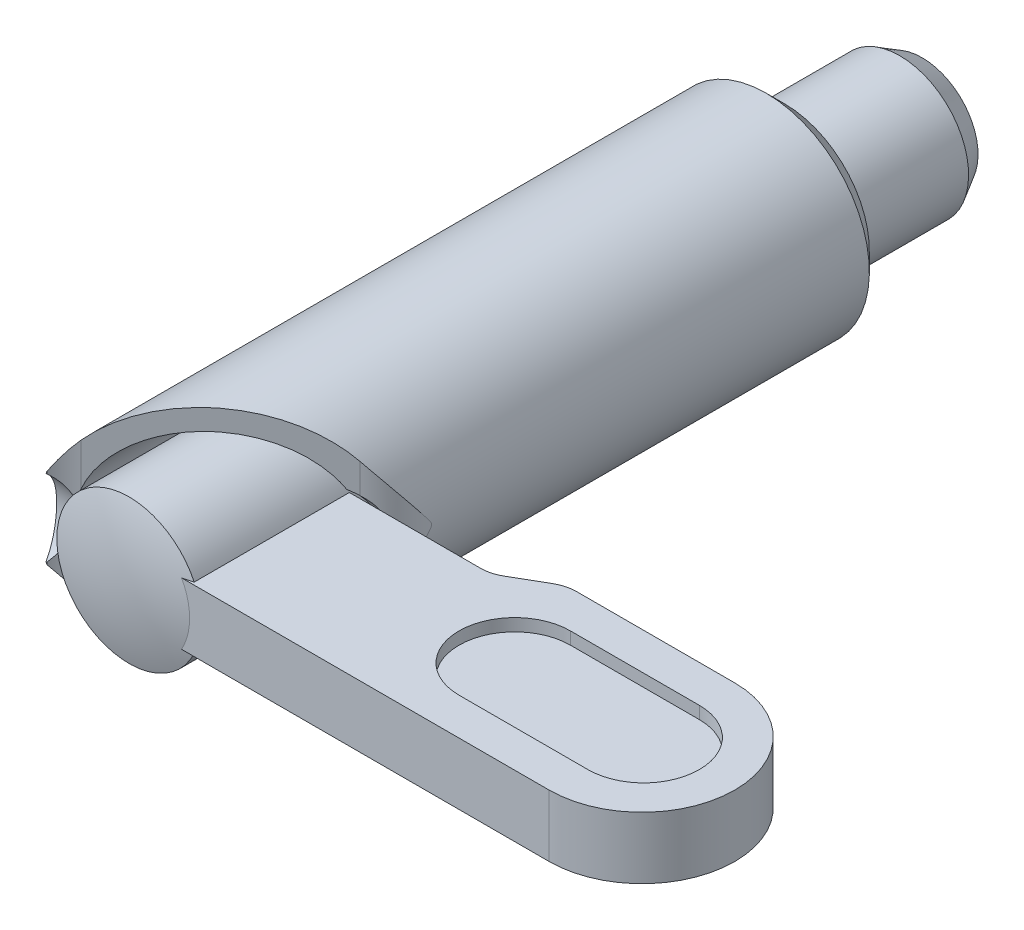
ISO-10303-21;
HEADER;
FILE_DESCRIPTION(('STEP AP214'),'2;1');
FILE_NAME('part.step','',(''),(''),'','','');
FILE_SCHEMA(('AUTOMOTIVE_DESIGN { 1 0 10303 214 1 1 1 1 }'));
ENDSEC;
DATA;
#1=APPLICATION_CONTEXT('core data for automotive mechanical design processes');
#2=APPLICATION_PROTOCOL_DEFINITION('international standard','automotive_design',2000,#1);
#3=PRODUCT_CONTEXT('',#1,'mechanical');
#4=PRODUCT('Part','Part','',(#3));
#5=PRODUCT_RELATED_PRODUCT_CATEGORY('part','',(#4));
#6=PRODUCT_DEFINITION_FORMATION('','',#4);
#7=PRODUCT_DEFINITION_CONTEXT('part definition',#1,'design');
#8=PRODUCT_DEFINITION('design','',#6,#7);
#9=PRODUCT_DEFINITION_SHAPE('','',#8);
#10=(LENGTH_UNIT() NAMED_UNIT(*) SI_UNIT(.MILLI.,.METRE.));
#11=(NAMED_UNIT(*) PLANE_ANGLE_UNIT() SI_UNIT($,.RADIAN.));
#12=(NAMED_UNIT(*) SI_UNIT($,.STERADIAN.) SOLID_ANGLE_UNIT());
#13=UNCERTAINTY_MEASURE_WITH_UNIT(LENGTH_MEASURE(1.E-05),#10,'distance_accuracy_value','');
#14=(GEOMETRIC_REPRESENTATION_CONTEXT(3) GLOBAL_UNCERTAINTY_ASSIGNED_CONTEXT((#13)) GLOBAL_UNIT_ASSIGNED_CONTEXT((#10,
#11,#12)) REPRESENTATION_CONTEXT('',''));
#15=CARTESIAN_POINT('',(0.,0.,0.));
#16=DIRECTION('',(0.,0.,1.));
#17=DIRECTION('',(1.,0.,0.));
#18=AXIS2_PLACEMENT_3D('',#15,#16,#17);
#19=CARTESIAN_POINT('',(-4.5911236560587,24.,36.34284085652));
#20=DIRECTION('',(-0.608367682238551,0.,-0.79365531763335));
#21=DIRECTION('',(0.79365531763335,0.,-0.608367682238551));
#22=AXIS2_PLACEMENT_3D('',#19,#20,#21);
#23=PLANE('',#22);
#24=CARTESIAN_POINT('',(2.07333496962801,0.,31.2342740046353));
#25=DIRECTION('',(-0.608367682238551,0.,-0.79365531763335));
#26=DIRECTION('',(-0.79365531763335,0.,0.608367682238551));
#27=AXIS2_PLACEMENT_3D('',#24,#25,#26);
#28=ELLIPSE('',#27,4.73397927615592,2.88000000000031);
#29=CARTESIAN_POINT('',(4.15973278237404,-2.39512487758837,29.6349688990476));
#30=VERTEX_POINT('',#29);
#31=CARTESIAN_POINT('',(4.5911236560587,-2.13765423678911,29.304291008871));
#32=VERTEX_POINT('',#31);
#33=EDGE_CURVE('E330',#30,#32,#28,.F.);
#34=ORIENTED_EDGE('',*,*,#33,.F.);
#35=CARTESIAN_POINT('',(0.,0.,32.8235659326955));
#36=DIRECTION('',(-0.608367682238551,0.,-0.79365531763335));
#37=DIRECTION('',(0.79365531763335,0.,-0.608367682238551));
#38=AXIS2_PLACEMENT_3D('',#35,#36,#37);
#39=ELLIPSE('',#38,6.04796552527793,4.8);
#40=CARTESIAN_POINT('',(-4.5911236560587,-1.40056544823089,36.34284085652));
#41=VERTEX_POINT('',#40);
#42=EDGE_CURVE('E472',#30,#41,#39,.T.);
#43=ORIENTED_EDGE('',*,*,#42,.T.);
#44=DIRECTION('',(0.,-1.,0.));
#45=VECTOR('',#44,1.);
#46=CARTESIAN_POINT('',(-4.5911236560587,24.,36.34284085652));
#47=LINE('',#46,#45);
#48=CARTESIAN_POINT('',(-4.5911236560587,-3.86284656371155,36.34284085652));
#49=VERTEX_POINT('',#48);
#50=EDGE_CURVE('E474',#41,#49,#47,.T.);
#51=ORIENTED_EDGE('',*,*,#50,.T.);
#52=CARTESIAN_POINT('',(0.,0.,32.8235659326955));
#53=DIRECTION('',(-0.608367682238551,0.,-0.79365531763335));
#54=DIRECTION('',(0.79365531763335,0.,-0.608367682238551));
#55=AXIS2_PLACEMENT_3D('',#52,#53,#54);
#56=ELLIPSE('',#55,7.55995690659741,6.);
#57=CARTESIAN_POINT('',(4.5911236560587,-3.86284656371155,29.304291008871));
#58=VERTEX_POINT('',#57);
#59=EDGE_CURVE('E441',#49,#58,#56,.F.);
#60=ORIENTED_EDGE('',*,*,#59,.T.);
#61=DIRECTION('',(0.,-1.,0.));
#62=VECTOR('',#61,1.);
#63=CARTESIAN_POINT('',(4.5911236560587,24.,29.304291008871));
#64=LINE('',#63,#62);
#65=EDGE_CURVE('E473',#32,#58,#64,.T.);
#66=ORIENTED_EDGE('',*,*,#65,.F.);
#67=EDGE_LOOP('',(#34,#43,#51,#60,#66));
#68=FACE_BOUND('',#67,.T.);
#69=ADVANCED_FACE('F14',(#68),#23,.F.);
#70=CARTESIAN_POINT('',(2.40100000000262,24.,26.4471318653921));
#71=DIRECTION('',(0.,-1.,0.));
#72=DIRECTION('',(1.,0.,0.));
#73=AXIS2_PLACEMENT_3D('',#70,#71,#72);
#74=CYLINDRICAL_SURFACE('',#73,3.59999999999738);
#75=CARTESIAN_POINT('',(4.5911236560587,-2.13765423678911,29.304291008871));
#76=CARTESIAN_POINT('',(4.63745048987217,-2.10561681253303,29.2687958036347));
#77=CARTESIAN_POINT('',(4.68201375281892,-2.07153338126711,29.2328324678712));
#78=CARTESIAN_POINT('',(4.76743931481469,-1.99924944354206,29.1606293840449));
#79=CARTESIAN_POINT('',(4.80830094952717,-1.96104820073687,29.1243895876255));
#80=CARTESIAN_POINT('',(4.88606220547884,-1.88058799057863,29.052371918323));
#81=CARTESIAN_POINT('',(4.92296887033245,-1.8383364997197,29.0165933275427));
#82=CARTESIAN_POINT('',(4.99280621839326,-1.74986126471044,28.9461321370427));
#83=CARTESIAN_POINT('',(5.0257374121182,-1.70363803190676,28.9114493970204));
#84=CARTESIAN_POINT('',(5.11867160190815,-1.55904934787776,28.8099011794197));
#85=CARTESIAN_POINT('',(5.17271007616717,-1.45487423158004,28.7456364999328));
#86=CARTESIAN_POINT('',(5.2654289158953,-1.23397116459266,28.629021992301));
#87=CARTESIAN_POINT('',(5.30411600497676,-1.11724873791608,28.5766669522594));
#88=CARTESIAN_POINT('',(5.36706004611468,-0.876826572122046,28.4880611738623));
#89=CARTESIAN_POINT('',(5.39157168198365,-0.753296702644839,28.4515293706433));
#90=CARTESIAN_POINT('',(5.42858419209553,-0.500693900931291,28.3951766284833));
#91=CARTESIAN_POINT('',(5.44107780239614,-0.37161766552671,28.3753657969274));
#92=CARTESIAN_POINT('',(5.45509745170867,-0.106881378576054,28.3530899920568));
#93=CARTESIAN_POINT('',(5.45623021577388,0.0288521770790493,28.3512470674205));
#94=CARTESIAN_POINT('',(5.44658896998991,0.298810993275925,28.3666282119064));
#95=CARTESIAN_POINT('',(5.43581464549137,0.433036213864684,28.3838527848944));
#96=CARTESIAN_POINT('',(5.40135021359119,0.698002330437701,28.436832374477));
#97=CARTESIAN_POINT('',(5.37748822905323,0.828672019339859,28.4728336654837));
#98=CARTESIAN_POINT('',(5.31526956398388,1.08060295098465,28.5613542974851));
#99=CARTESIAN_POINT('',(5.27691929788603,1.20186832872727,28.6138663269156));
#100=CARTESIAN_POINT('',(5.18534962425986,1.42834249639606,28.7302693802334));
#101=CARTESIAN_POINT('',(5.13253582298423,1.53388275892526,28.7938348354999));
#102=CARTESIAN_POINT('',(5.01077146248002,1.72973848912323,28.928517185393));
#103=CARTESIAN_POINT('',(4.94182836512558,1.82006096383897,28.9996305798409));
#104=CARTESIAN_POINT('',(4.82376514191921,1.94612121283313,29.1104820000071));
#105=CARTESIAN_POINT('',(4.78019017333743,1.98780630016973,29.1495462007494));
#106=CARTESIAN_POINT('',(4.6887986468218,2.06632160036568,29.2273460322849));
#107=CARTESIAN_POINT('',(4.64099024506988,2.10316082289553,29.2660821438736));
#108=CARTESIAN_POINT('',(4.5911236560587,2.13765423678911,29.304291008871));
#109=B_SPLINE_CURVE_WITH_KNOTS('',3,(#75,#76,#77,#78,#79,#80,#81,#82,#83,#84,#85,#86,#87,#88,
#89,#90,#91,#92,#93,#94,#95,#96,#97,#98,#99,#100,#101,#102,#103,#104,#105,#106,#107,#108),
.UNSPECIFIED.,.F.,.F.,(4,2,2,2,2,2,2,2,2,2,2,2,2,2,2,2,4),(0.,0.199685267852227,
0.399406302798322,0.598765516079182,0.798099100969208,1.19730526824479,1.59633639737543,
1.98795576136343,2.37981167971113,2.78518739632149,3.19057382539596,3.60141620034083,
4.01207689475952,4.41222899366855,4.8121963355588,5.0274892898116,5.24237612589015),.UNSPECIFIED.);
#110=CARTESIAN_POINT('',(4.5911236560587,2.13765423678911,29.304291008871));
#111=VERTEX_POINT('',#110);
#112=EDGE_CURVE('E322',#32,#111,#109,.T.);
#113=ORIENTED_EDGE('',*,*,#112,.F.);
#114=ORIENTED_EDGE('',*,*,#65,.T.);
#115=CARTESIAN_POINT('',(0.,6.,29.129518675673));
#116=CARTESIAN_POINT('',(-0.149832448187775,5.99999874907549,28.9953924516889));
#117=CARTESIAN_POINT('',(-0.288439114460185,5.99437295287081,28.8486408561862));
#118=CARTESIAN_POINT('',(-0.539144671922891,5.97705575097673,28.5342514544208));
#119=CARTESIAN_POINT('',(-0.651220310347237,5.96535905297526,28.3665955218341));
#120=CARTESIAN_POINT('',(-0.845744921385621,5.9409037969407,28.0152228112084));
#121=CARTESIAN_POINT('',(-0.92822854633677,5.92814650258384,27.8315251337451));
#122=CARTESIAN_POINT('',(-1.06148614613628,5.9057469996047,27.4528456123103));
#123=CARTESIAN_POINT('',(-1.11227176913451,5.89610364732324,27.257867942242));
#124=CARTESIAN_POINT('',(-1.18087874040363,5.88275288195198,26.8606673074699));
#125=CARTESIAN_POINT('',(-1.19848460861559,5.87908429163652,26.6584056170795));
#126=CARTESIAN_POINT('',(-1.19949304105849,5.87887910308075,26.2537981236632));
#127=CARTESIAN_POINT('',(-1.18289653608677,5.88234231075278,26.051452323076));
#128=CARTESIAN_POINT('',(-1.11665208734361,5.89526686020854,25.6562111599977));
#129=CARTESIAN_POINT('',(-1.0676026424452,5.90461944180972,25.4632113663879));
#130=CARTESIAN_POINT('',(-0.938510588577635,5.92650517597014,25.0880640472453));
#131=CARTESIAN_POINT('',(-0.858460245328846,5.93903912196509,24.9059192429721));
#132=CARTESIAN_POINT('',(-0.6677661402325,5.96350824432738,24.554169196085));
#133=CARTESIAN_POINT('',(-0.556625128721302,5.97542960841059,24.3848299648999));
#134=CARTESIAN_POINT('',(-0.369835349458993,5.98891620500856,24.1465426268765));
#135=CARTESIAN_POINT('',(-0.304183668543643,5.99268002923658,24.0696954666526));
#136=CARTESIAN_POINT('',(-0.166621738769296,5.99808067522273,23.9217605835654));
#137=CARTESIAN_POINT('',(-0.0947142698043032,5.99971843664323,23.8506703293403));
#138=CARTESIAN_POINT('',(0.0541657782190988,6.00021307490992,23.7153925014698));
#139=CARTESIAN_POINT('',(0.131087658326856,5.99909453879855,23.6511491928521));
#140=CARTESIAN_POINT('',(0.289912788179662,5.99351813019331,23.529372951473));
#141=CARTESIAN_POINT('',(0.371813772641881,5.98906176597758,23.4718370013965));
#142=CARTESIAN_POINT('',(0.539871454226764,5.97625603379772,23.363924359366));
#143=CARTESIAN_POINT('',(0.626026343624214,5.96790830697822,23.313544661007));
#144=CARTESIAN_POINT('',(0.801797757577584,5.94684382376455,23.2202995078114));
#145=CARTESIAN_POINT('',(0.891414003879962,5.93412741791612,23.1774334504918));
#146=CARTESIAN_POINT('',(1.06636624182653,5.90509317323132,23.102416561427));
#147=CARTESIAN_POINT('',(1.15151820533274,5.88911754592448,23.0697027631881));
#148=CARTESIAN_POINT('',(1.32327085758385,5.8529188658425,23.0110384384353));
#149=CARTESIAN_POINT('',(1.40987201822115,5.83269440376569,22.9850901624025));
#150=CARTESIAN_POINT('',(1.58367432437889,5.78792005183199,22.9399917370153));
#151=CARTESIAN_POINT('',(1.67087513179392,5.7633724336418,22.9208380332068));
#152=CARTESIAN_POINT('',(1.84517572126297,5.70996127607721,22.8891942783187));
#153=CARTESIAN_POINT('',(1.93227545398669,5.68109614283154,22.8767066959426));
#154=CARTESIAN_POINT('',(2.18731820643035,5.58994387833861,22.8495032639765));
#155=CARTESIAN_POINT('',(2.35420963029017,5.52176616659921,22.8437481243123));
#156=CARTESIAN_POINT('',(2.68050208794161,5.37096893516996,22.8542773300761));
#157=CARTESIAN_POINT('',(2.83989961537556,5.28834273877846,22.8705718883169));
#158=CARTESIAN_POINT('',(3.09987658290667,5.13864828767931,22.9139901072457));
#159=CARTESIAN_POINT('',(3.203225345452,5.07482700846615,22.9361152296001));
#160=CARTESIAN_POINT('',(3.4045032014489,4.94205491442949,22.9882600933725));
#161=CARTESIAN_POINT('',(3.50243067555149,4.87310258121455,23.0182821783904));
#162=CARTESIAN_POINT('',(3.78773583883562,4.65934396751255,23.118821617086));
#163=CARTESIAN_POINT('',(3.96647443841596,4.50773047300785,23.1997823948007));
#164=CARTESIAN_POINT('',(4.24760325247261,4.2406366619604,23.3540415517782));
#165=CARTESIAN_POINT('',(4.35645642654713,4.12857246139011,23.421900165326));
#166=CARTESIAN_POINT('',(4.5628044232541,3.89930309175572,23.5657432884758));
#167=CARTESIAN_POINT('',(4.66029971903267,3.78209813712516,23.6417274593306));
#168=CARTESIAN_POINT('',(4.84433427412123,3.54333241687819,23.8004510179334));
#169=CARTESIAN_POINT('',(4.93085216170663,3.42176372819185,23.8832030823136));
#170=CARTESIAN_POINT('',(5.09306925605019,3.1752810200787,24.054092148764));
#171=CARTESIAN_POINT('',(5.16876847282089,3.05036700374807,24.1422291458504));
#172=CARTESIAN_POINT('',(5.3366456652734,2.74957527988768,24.3573801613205));
#173=CARTESIAN_POINT('',(5.42407153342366,2.57245810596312,24.4863834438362));
#174=CARTESIAN_POINT('',(5.57983611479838,2.21440062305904,24.7505121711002));
#175=CARTESIAN_POINT('',(5.64816670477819,2.0334587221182,24.8856401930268));
#176=CARTESIAN_POINT('',(5.76633378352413,1.6691320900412,25.1599681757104));
#177=CARTESIAN_POINT('',(5.81619852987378,1.48575153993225,25.2991615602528));
#178=CARTESIAN_POINT('',(5.89810195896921,1.11716298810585,25.5801327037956));
#179=CARTESIAN_POINT('',(5.9301467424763,0.931955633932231,25.7219095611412));
#180=CARTESIAN_POINT('',(5.96809941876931,0.629009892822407,25.9532455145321));
#181=CARTESIAN_POINT('',(5.97929612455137,0.51181430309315,26.0426012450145));
#182=CARTESIAN_POINT('',(5.99143073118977,0.327430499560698,26.180185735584));
#183=CARTESIAN_POINT('',(5.99471452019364,0.260889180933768,26.2292385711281));
#184=CARTESIAN_POINT('',(5.99801450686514,0.158149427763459,26.2988860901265));
#185=CARTESIAN_POINT('',(5.99884343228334,0.123563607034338,26.3213618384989));
#186=CARTESIAN_POINT('',(5.99951208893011,0.077068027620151,26.3435208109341));
#187=CARTESIAN_POINT('',(5.99962851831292,0.0674813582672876,26.3477021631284));
#188=CARTESIAN_POINT('',(5.99981716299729,0.0478587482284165,26.3547916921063));
#189=CARTESIAN_POINT('',(5.99988955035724,0.037824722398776,26.3577048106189));
#190=CARTESIAN_POINT('',(5.99997491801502,0.0192411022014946,26.3612106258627));
#191=CARTESIAN_POINT('',(5.99999637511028,0.0107578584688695,26.3621315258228));
#192=CARTESIAN_POINT('',(6.00000276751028,-0.00622162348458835,26.3624019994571));
#193=CARTESIAN_POINT('',(5.9999877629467,-0.0147178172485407,26.3617541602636));
#194=CARTESIAN_POINT('',(5.9999111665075,-0.0346381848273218,26.3585817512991));
#195=CARTESIAN_POINT('',(5.99983413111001,-0.0459573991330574,26.3554412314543));
#196=CARTESIAN_POINT('',(5.9996241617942,-0.068063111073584,26.3475265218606));
#197=CARTESIAN_POINT('',(5.99949073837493,-0.0788439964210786,26.342738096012));
#198=CARTESIAN_POINT('',(5.99863119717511,-0.136706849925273,26.3146807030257));
#199=CARTESIAN_POINT('',(5.99745196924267,-0.180288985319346,26.2848083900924));
#200=CARTESIAN_POINT('',(5.99422904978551,-0.26646140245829,26.2241146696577));
#201=CARTESIAN_POINT('',(5.99218298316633,-0.309048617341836,26.1932908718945));
#202=CARTESIAN_POINT('',(5.98477662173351,-0.435427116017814,26.1003101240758));
#203=CARTESIAN_POINT('',(5.97813608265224,-0.518537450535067,26.0371600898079));
#204=CARTESIAN_POINT('',(5.96141631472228,-0.684412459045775,25.9108764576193));
#205=CARTESIAN_POINT('',(5.95133464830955,-0.767176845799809,25.8477429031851));
#206=CARTESIAN_POINT('',(5.92772444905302,-0.932221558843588,25.7216681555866));
#207=CARTESIAN_POINT('',(5.91420031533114,-1.01450236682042,25.6587268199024));
#208=CARTESIAN_POINT('',(5.88367334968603,-1.17870920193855,25.5332585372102));
#209=CARTESIAN_POINT('',(5.86667081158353,-1.2606352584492,25.4707315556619));
#210=CARTESIAN_POINT('',(5.80993608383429,-1.50780030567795,25.2824560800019));
#211=CARTESIAN_POINT('',(5.76475584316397,-1.67245541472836,25.1575258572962));
#212=CARTESIAN_POINT('',(5.65958701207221,-1.99965437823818,24.9110388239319));
#213=CARTESIAN_POINT('',(5.59959235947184,-2.16219733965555,24.7894834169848));
#214=CARTESIAN_POINT('',(5.46423214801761,-2.48449904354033,24.550971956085));
#215=CARTESIAN_POINT('',(5.38885494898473,-2.64425557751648,24.4340194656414));
#216=CARTESIAN_POINT('',(5.2221981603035,-2.95981008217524,24.2064339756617));
#217=CARTESIAN_POINT('',(5.1309252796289,-3.11560969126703,24.095798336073));
#218=CARTESIAN_POINT('',(4.88918979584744,-3.48767674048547,23.8370972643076));
#219=CARTESIAN_POINT('',(4.73009050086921,-3.70137409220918,23.693208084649));
#220=CARTESIAN_POINT('',(4.37637008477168,-4.11350760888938,23.4294337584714));
#221=CARTESIAN_POINT('',(4.18180689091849,-4.3119679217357,23.3095101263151));
#222=CARTESIAN_POINT('',(3.8042285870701,-4.64500508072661,23.1268289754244));
#223=CARTESIAN_POINT('',(3.62843167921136,-4.78391974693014,23.0572816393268));
#224=CARTESIAN_POINT('',(3.3497078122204,-4.97919285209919,22.9730307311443));
#225=CARTESIAN_POINT('',(3.25430901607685,-5.04209312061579,22.9482940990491));
#226=CARTESIAN_POINT('',(3.0588471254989,-5.1630065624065,22.9063384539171));
#227=CARTESIAN_POINT('',(2.95878489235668,-5.22102063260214,22.889118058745));
#228=CARTESIAN_POINT('',(2.77263765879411,-5.32180685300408,22.8653626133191));
#229=CARTESIAN_POINT('',(2.68720092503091,-5.36546240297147,22.8574784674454));
#230=CARTESIAN_POINT('',(2.51405132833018,-5.44874006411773,22.8478633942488));
#231=CARTESIAN_POINT('',(2.42633892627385,-5.48836298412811,22.8461312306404));
#232=CARTESIAN_POINT('',(2.24920986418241,-5.56329949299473,22.8492429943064));
#233=CARTESIAN_POINT('',(2.15979339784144,-5.59861356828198,22.8540861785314));
#234=CARTESIAN_POINT('',(1.97997253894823,-5.66470468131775,22.8706973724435));
#235=CARTESIAN_POINT('',(1.88956862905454,-5.69548383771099,22.8824621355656));
#236=CARTESIAN_POINT('',(1.70806811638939,-5.7525295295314,22.9132447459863));
#237=CARTESIAN_POINT('',(1.61697028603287,-5.77877331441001,22.9322977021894));
#238=CARTESIAN_POINT('',(1.43541422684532,-5.82652499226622,22.9777806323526));
#239=CARTESIAN_POINT('',(1.34495576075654,-5.84803474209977,23.0042077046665));
#240=CARTESIAN_POINT('',(1.16550873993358,-5.88642596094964,23.0644523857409));
#241=CARTESIAN_POINT('',(1.07652048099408,-5.90330650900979,23.0982714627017));
#242=CARTESIAN_POINT('',(0.900907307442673,-5.93264631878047,23.1731687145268));
#243=CARTESIAN_POINT('',(0.814282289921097,-5.94510577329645,23.214246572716));
#244=CARTESIAN_POINT('',(0.650366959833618,-5.96517721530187,23.30019439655));
#245=CARTESIAN_POINT('',(0.572854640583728,-5.97307462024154,23.3445752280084));
#246=CARTESIAN_POINT('',(0.421151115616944,-5.98568587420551,23.4391091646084));
#247=CARTESIAN_POINT('',(0.346961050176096,-5.99039863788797,23.4892642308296));
#248=CARTESIAN_POINT('',(0.130246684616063,-6.0003246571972,23.6479080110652));
#249=CARTESIAN_POINT('',(-0.00655897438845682,-6.00134094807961,23.7646472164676));
#250=CARTESIAN_POINT('',(-0.266493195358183,-5.99555354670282,24.0223757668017));
#251=CARTESIAN_POINT('',(-0.388795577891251,-5.98841635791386,24.1641836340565));
#252=CARTESIAN_POINT('',(-0.609895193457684,-5.96995379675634,24.4648735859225));
#253=CARTESIAN_POINT('',(-0.708683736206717,-5.95862687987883,24.6237619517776));
#254=CARTESIAN_POINT('',(-0.88667509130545,-5.93485349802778,24.9668706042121));
#255=CARTESIAN_POINT('',(-0.96395345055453,-5.92238517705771,25.1520912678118));
#256=CARTESIAN_POINT('',(-1.08674405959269,-5.90109314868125,25.5329787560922));
#257=CARTESIAN_POINT('',(-1.1322576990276,-5.89226928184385,25.7286451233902));
#258=CARTESIAN_POINT('',(-1.19038085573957,-5.88080808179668,26.1266153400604));
#259=CARTESIAN_POINT('',(-1.20272407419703,-5.87822083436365,26.3289597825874));
#260=CARTESIAN_POINT('',(-1.19332722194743,-5.88013526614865,26.7328077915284));
#261=CARTESIAN_POINT('',(-1.17158865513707,-5.88463663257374,26.9343113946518));
#262=CARTESIAN_POINT('',(-1.09537171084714,-5.89928853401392,27.3273623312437));
#263=CARTESIAN_POINT('',(-1.04143432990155,-5.90934552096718,27.5190185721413));
#264=CARTESIAN_POINT('',(-0.902851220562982,-5.9320966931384,27.8907235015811));
#265=CARTESIAN_POINT('',(-0.818197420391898,-5.94479157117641,28.0707691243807));
#266=CARTESIAN_POINT('',(-0.618435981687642,-5.96890163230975,28.4178602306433));
#267=CARTESIAN_POINT('',(-0.502791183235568,-5.98028862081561,28.5846016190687));
#268=CARTESIAN_POINT('',(-0.30958499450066,-5.99235538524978,28.8184195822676));
#269=CARTESIAN_POINT('',(-0.241851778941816,-5.9955423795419,28.8936789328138));
#270=CARTESIAN_POINT('',(-0.100264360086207,-5.99957981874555,29.0382498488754));
#271=CARTESIAN_POINT('',(-0.0264129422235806,-6.00043132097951,29.1075640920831));
#272=CARTESIAN_POINT('',(0.125730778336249,-5.99915772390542,29.2387435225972));
#273=CARTESIAN_POINT('',(0.20394236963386,-5.99707596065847,29.3007027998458));
#274=CARTESIAN_POINT('',(0.365095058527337,-5.98942463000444,29.4178229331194));
#275=CARTESIAN_POINT('',(0.44803398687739,-5.98385665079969,29.472986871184));
#276=CARTESIAN_POINT('',(0.617893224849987,-5.96870789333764,29.57609287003));
#277=CARTESIAN_POINT('',(0.704811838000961,-5.95912881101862,29.62403797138));
#278=CARTESIAN_POINT('',(0.881819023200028,-5.93551714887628,29.7123838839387));
#279=CARTESIAN_POINT('',(0.97190734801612,-5.92148491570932,29.7527852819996));
#280=CARTESIAN_POINT('',(1.14734009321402,-5.8899011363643,29.823012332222));
#281=CARTESIAN_POINT('',(1.23251910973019,-5.87270162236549,29.8534111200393));
#282=CARTESIAN_POINT('',(1.40406808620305,-5.83406599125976,29.9075102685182));
#283=CARTESIAN_POINT('',(1.49043843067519,-5.81262847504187,29.9312084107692));
#284=CARTESIAN_POINT('',(1.66354190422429,-5.76547189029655,29.9719090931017));
#285=CARTESIAN_POINT('',(1.75027484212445,-5.73975485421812,29.9889147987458));
#286=CARTESIAN_POINT('',(1.9234247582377,-5.68407686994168,30.0163923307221));
#287=CARTESIAN_POINT('',(2.00984160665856,-5.65411434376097,30.0268617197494));
#288=CARTESIAN_POINT('',(2.26411449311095,-5.55931138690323,30.0484845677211));
#289=CARTESIAN_POINT('',(2.43062987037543,-5.48856961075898,30.0506736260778));
#290=CARTESIAN_POINT('',(2.75557372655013,-5.33285785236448,30.0333319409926));
#291=CARTESIAN_POINT('',(2.91399832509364,-5.24788112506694,30.0137908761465));
#292=CARTESIAN_POINT('',(3.17365852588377,-5.09345888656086,29.9649136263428));
#293=CARTESIAN_POINT('',(3.27768675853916,-5.02710054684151,29.9403342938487));
#294=CARTESIAN_POINT('',(3.48000175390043,-4.88923173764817,29.8832354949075));
#295=CARTESIAN_POINT('',(3.57828670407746,-4.81771965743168,29.8507135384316));
#296=CARTESIAN_POINT('',(3.86424231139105,-4.59627248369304,29.7426554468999));
#297=CARTESIAN_POINT('',(4.04283656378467,-4.43953326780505,29.6566635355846));
#298=CARTESIAN_POINT('',(4.32336710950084,-4.16347151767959,29.4937905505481));
#299=CARTESIAN_POINT('',(4.43196312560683,-4.04750907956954,29.4222723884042));
#300=CARTESIAN_POINT('',(4.63737065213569,-3.81042861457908,29.2711173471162));
#301=CARTESIAN_POINT('',(4.73417778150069,-3.68930869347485,29.1914774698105));
#302=CARTESIAN_POINT('',(4.91638341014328,-3.44277857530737,29.0255162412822));
#303=CARTESIAN_POINT('',(5.00176212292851,-3.31736139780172,28.9391837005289));
#304=CARTESIAN_POINT('',(5.16130324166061,-3.06324220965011,28.7612196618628));
#305=CARTESIAN_POINT('',(5.23546589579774,-2.93454027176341,28.6695882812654));
#306=CARTESIAN_POINT('',(5.39869978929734,-2.62581530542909,28.4469667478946));
#307=CARTESIAN_POINT('',(5.48296490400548,-2.44460976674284,28.314079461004));
#308=CARTESIAN_POINT('',(5.63194617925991,-2.07852538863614,28.042431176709));
#309=CARTESIAN_POINT('',(5.69665236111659,-1.89364472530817,27.9036672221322));
#310=CARTESIAN_POINT('',(5.80709812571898,-1.52157487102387,27.6224286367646));
#311=CARTESIAN_POINT('',(5.85286585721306,-1.33438953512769,27.4799598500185));
#312=CARTESIAN_POINT('',(5.9260594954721,-0.958407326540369,27.1926494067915));
#313=CARTESIAN_POINT('',(5.95349883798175,-0.76961173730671,27.0478095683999));
#314=CARTESIAN_POINT('',(5.98118235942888,-0.484365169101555,26.8313649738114));
#315=CARTESIAN_POINT('',(5.98816456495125,-0.388810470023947,26.7592559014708));
#316=CARTESIAN_POINT('',(5.99531872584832,-0.242256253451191,26.6523463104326));
#317=CARTESIAN_POINT('',(5.99715131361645,-0.192252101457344,26.616499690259));
#318=CARTESIAN_POINT('',(5.99868328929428,-0.126376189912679,26.5765436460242));
#319=CARTESIAN_POINT('',(5.99895427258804,-0.11286353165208,26.5687041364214));
#320=CARTESIAN_POINT('',(5.9994120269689,-0.0851418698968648,26.5542779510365));
#321=CARTESIAN_POINT('',(5.99959886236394,-0.070933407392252,26.5476903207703));
#322=CARTESIAN_POINT('',(5.99981804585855,-0.0475204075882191,26.5394292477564));
#323=CARTESIAN_POINT('',(5.99988232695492,-0.0386539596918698,26.5368484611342));
#324=CARTESIAN_POINT('',(5.99997111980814,-0.020652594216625,26.5332156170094));
#325=CARTESIAN_POINT('',(5.9999959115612,-0.0115200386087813,26.5321528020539));
#326=CARTESIAN_POINT('',(6.00000317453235,0.00683625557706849,26.5318435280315));
#327=CARTESIAN_POINT('',(5.99998538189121,0.0160602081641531,26.5326083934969));
#328=CARTESIAN_POINT('',(5.99990908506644,0.0342665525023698,26.5357680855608));
#329=CARTESIAN_POINT('',(5.99985029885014,0.0432468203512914,26.5381742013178));
#330=CARTESIAN_POINT('',(5.99951121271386,0.082487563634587,26.5510746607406));
#331=CARTESIAN_POINT('',(5.99904173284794,0.110754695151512,26.5669055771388));
#332=CARTESIAN_POINT('',(5.99776635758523,0.166003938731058,26.6007398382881));
#333=CARTESIAN_POINT('',(5.99695566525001,0.192961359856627,26.6187714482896));
#334=CARTESIAN_POINT('',(5.99406846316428,0.271788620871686,26.6732505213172));
#335=CARTESIAN_POINT('',(5.9915217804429,0.322929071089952,26.710879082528));
#336=CARTESIAN_POINT('',(5.98516274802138,0.424752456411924,26.7866275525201));
#337=CARTESIAN_POINT('',(5.98134884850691,0.475434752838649,26.8247480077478));
#338=CARTESIAN_POINT('',(5.9724902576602,0.576102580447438,26.9008987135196));
#339=CARTESIAN_POINT('',(5.96745642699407,0.626090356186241,26.9389269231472));
#340=CARTESIAN_POINT('',(5.95614038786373,0.725885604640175,27.0149871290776));
#341=CARTESIAN_POINT('',(5.94985856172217,0.775693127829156,27.0530191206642));
#342=CARTESIAN_POINT('',(5.91505646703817,1.02627655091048,27.2444429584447));
#343=CARTESIAN_POINT('',(5.87693607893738,1.2261651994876,27.397411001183));
#344=CARTESIAN_POINT('',(5.77974607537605,1.62370517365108,27.699880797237));
#345=CARTESIAN_POINT('',(5.72065862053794,1.82135444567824,27.8493794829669));
#346=CARTESIAN_POINT('',(5.58056101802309,2.21379550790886,28.1432942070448));
#347=CARTESIAN_POINT('',(5.49948026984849,2.40857592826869,28.2876921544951));
#348=CARTESIAN_POINT('',(5.31458057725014,2.79297076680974,28.5682788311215));
#349=CARTESIAN_POINT('',(5.21078039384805,2.98258930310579,28.7044742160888));
#350=CARTESIAN_POINT('',(4.95922281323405,3.38706255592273,28.9882739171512));
#351=CARTESIAN_POINT('',(4.80697263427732,3.6006337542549,29.1337985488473));
#352=CARTESIAN_POINT('',(4.46796155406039,4.01353700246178,29.4025268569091));
#353=CARTESIAN_POINT('',(4.2812766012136,4.21289907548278,29.5257784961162));
#354=CARTESIAN_POINT('',(3.91145736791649,4.55534058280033,29.7202510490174));
#355=CARTESIAN_POINT('',(3.7344957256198,4.70188518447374,29.7969163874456));
#356=CARTESIAN_POINT('',(3.45268047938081,4.90842118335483,29.891517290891));
#357=CARTESIAN_POINT('',(3.35602022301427,4.9750490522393,29.9196502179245));
#358=CARTESIAN_POINT('',(3.15755877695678,5.10330838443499,29.9682175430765));
#359=CARTESIAN_POINT('',(3.0557586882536,5.16494091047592,29.9886535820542));
#360=CARTESIAN_POINT('',(2.86777297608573,5.27116485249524,30.0177533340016));
#361=CARTESIAN_POINT('',(2.78237787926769,5.3167459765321,30.0279298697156));
#362=CARTESIAN_POINT('',(2.60907509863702,5.40389928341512,30.0421644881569));
#363=CARTESIAN_POINT('',(2.52116795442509,5.44547231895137,30.046223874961));
#364=CARTESIAN_POINT('',(2.34338860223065,5.5243084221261,30.0477680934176));
#365=CARTESIAN_POINT('',(2.25351662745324,5.56157199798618,30.0452537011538));
#366=CARTESIAN_POINT('',(2.07250812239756,5.6315289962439,30.0332599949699));
#367=CARTESIAN_POINT('',(1.98137221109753,5.66422457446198,30.0237839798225));
#368=CARTESIAN_POINT('',(1.7980530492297,5.72506622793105,29.9974946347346));
#369=CARTESIAN_POINT('',(1.70586679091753,5.75318566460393,29.9806403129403));
#370=CARTESIAN_POINT('',(1.52186401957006,5.80457163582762,29.9394099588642));
#371=CARTESIAN_POINT('',(1.43004737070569,5.82784015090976,29.9150370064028));
#372=CARTESIAN_POINT('',(1.24766028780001,5.86959040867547,29.8587166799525));
#373=CARTESIAN_POINT('',(1.15708973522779,5.88807260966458,29.8267700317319));
#374=CARTESIAN_POINT('',(0.978127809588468,5.92043474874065,29.7554135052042));
#375=CARTESIAN_POINT('',(0.889736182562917,5.93431522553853,29.7160045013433));
#376=CARTESIAN_POINT('',(0.65840937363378,5.96554040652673,29.601381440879));
#377=CARTESIAN_POINT('',(0.518081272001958,5.97910068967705,29.5197293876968));
#378=CARTESIAN_POINT('',(0.24939235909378,5.99633183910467,29.3379726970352));
#379=CARTESIAN_POINT('',(0.121033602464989,6.00000101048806,29.2378649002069));
#380=CARTESIAN_POINT('',(0.,6.,29.129518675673));
#381=B_SPLINE_CURVE_WITH_KNOTS('',3,(#115,#116,#117,#118,#119,#120,#121,#122,#123,#124,#125,
#126,#127,#128,#129,#130,#131,#132,#133,#134,#135,#136,#137,#138,#139,#140,#141,#142,#143,#144,
#145,#146,#147,#148,#149,#150,#151,#152,#153,#154,#155,#156,#157,#158,#159,#160,#161,#162,#163,
#164,#165,#166,#167,#168,#169,#170,#171,#172,#173,#174,#175,#176,#177,#178,#179,#180,#181,#182,
#183,#184,#185,#186,#187,#188,#189,#190,#191,#192,#193,#194,#195,#196,#197,#198,#199,#200,#201,
#202,#203,#204,#205,#206,#207,#208,#209,#210,#211,#212,#213,#214,#215,#216,#217,#218,#219,#220,
#221,#222,#223,#224,#225,#226,#227,#228,#229,#230,#231,#232,#233,#234,#235,#236,#237,#238,#239,
#240,#241,#242,#243,#244,#245,#246,#247,#248,#249,#250,#251,#252,#253,#254,#255,#256,#257,#258,
#259,#260,#261,#262,#263,#264,#265,#266,#267,#268,#269,#270,#271,#272,#273,#274,#275,#276,#277,
#278,#279,#280,#281,#282,#283,#284,#285,#286,#287,#288,#289,#290,#291,#292,#293,#294,#295,#296,
#297,#298,#299,#300,#301,#302,#303,#304,#305,#306,#307,#308,#309,#310,#311,#312,#313,#314,#315,
#316,#317,#318,#319,#320,#321,#322,#323,#324,#325,#326,#327,#328,#329,#330,#331,#332,#333,#334,
#335,#336,#337,#338,#339,#340,#341,#342,#343,#344,#345,#346,#347,#348,#349,#350,#351,#352,#353,
#354,#355,#356,#357,#358,#359,#360,#361,#362,#363,#364,#365,#366,#367,#368,#369,#370,#371,#372,
#373,#374,#375,#376,#377,#378,#379,#380),.UNSPECIFIED.,.T.,.F.,(4,2,2,2,2,2,2,2,2,2,2,2,2,2,2,2,
2,2,2,2,2,2,2,2,2,2,2,2,2,2,2,2,2,2,2,2,2,2,2,2,2,2,2,2,2,2,2,2,2,2,2,2,2,2,2,2,2,2,2,2,2,2,2,2,
2,2,2,2,2,2,2,2,2,2,2,2,2,2,2,2,2,2,2,2,2,2,2,2,2,2,2,2,2,2,2,2,2,2,2,2,2,2,2,2,2,2,2,2,2,2,2,2,
2,2,2,2,2,2,2,2,2,2,2,2,2,2,2,2,2,2,2,2,4),(0.,0.602685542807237,1.2058973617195,
1.80840049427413,2.4106820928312,3.01686180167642,3.6230250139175,4.21830979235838,
4.81374318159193,5.4193052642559,5.72242314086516,6.02540700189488,6.32569795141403,
6.62585328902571,6.92588215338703,7.22588694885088,7.50336011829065,7.78092546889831,
8.05834540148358,8.33586800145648,8.87453926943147,9.41346012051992,9.78337426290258,
10.1533983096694,10.8940083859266,11.4044246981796,11.9148197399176,12.4261936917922,
12.9375671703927,13.644293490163,14.35131999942,15.0572600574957,15.7629582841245,
16.2060212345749,16.4544616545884,16.5776687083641,16.60899794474,16.6402039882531,
16.6656713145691,16.6910966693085,16.7261165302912,16.7614468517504,16.9190543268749,
17.0770964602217,17.3906165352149,17.7043591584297,18.0177028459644,18.3310200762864,
18.9651393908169,19.599518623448,20.2343796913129,20.8689734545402,21.7743906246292,
22.6783419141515,23.379299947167,23.7296842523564,24.0800040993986,24.368523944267,
24.6569858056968,24.9454150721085,25.233709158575,25.5234098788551,25.8129967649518,
26.1026412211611,26.3922730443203,26.6609573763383,26.9297332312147,27.4668235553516,
28.0266934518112,28.5867699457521,29.1872077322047,29.7876192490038,30.3928367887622,
30.9980276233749,31.5933255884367,32.1887801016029,32.7953101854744,33.0988986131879,
33.402349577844,33.7013640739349,34.0002424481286,34.29899458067,34.5977234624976,
34.8735635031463,35.1494947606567,35.4252953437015,35.7011987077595,36.2415785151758,
36.7822151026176,37.1591666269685,37.5362364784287,38.2909984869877,38.813095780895,
39.3353865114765,39.858570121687,40.3817421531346,41.1006883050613,41.8200006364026,
42.5382399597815,43.2559521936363,43.6157805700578,43.8001419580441,43.8469982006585,
43.8938185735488,43.9214337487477,43.9488522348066,43.976441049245,44.0042215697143,
44.1003393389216,44.1978560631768,44.3882618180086,44.5789013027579,44.7679022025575,
44.9568452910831,45.7195898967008,46.482985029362,47.248860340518,48.0141055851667,
48.9112493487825,49.8064375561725,50.530112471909,50.8919019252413,51.2536142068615,
51.5453305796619,51.8369847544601,52.128604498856,52.4200861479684,52.7132081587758,
53.0062102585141,53.2991842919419,53.5921240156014,54.0788857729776,54.5657309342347),.UNSPECIFIED.);
#382=CARTESIAN_POINT('',(4.5911236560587,3.86284656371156,29.304291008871));
#383=VERTEX_POINT('',#382);
#384=EDGE_CURVE('E437',#58,#383,#381,.T.);
#385=ORIENTED_EDGE('',*,*,#384,.T.);
#386=EDGE_CURVE('E476',#383,#111,#64,.T.);
#387=ORIENTED_EDGE('',*,*,#386,.T.);
#388=EDGE_LOOP('',(#113,#114,#385,#387));
#389=FACE_BOUND('',#388,.T.);
#390=ADVANCED_FACE('F332',(#389),#74,.T.);
#391=CARTESIAN_POINT('',(2.07333496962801,0.,31.2342740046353));
#392=DIRECTION('',(-0.608367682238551,0.,-0.79365531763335));
#393=DIRECTION('',(-0.79365531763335,0.,0.608367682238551));
#394=AXIS2_PLACEMENT_3D('',#391,#392,#393);
#395=ELLIPSE('',#394,4.73397927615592,2.88000000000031);
#396=CARTESIAN_POINT('',(4.15973278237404,2.39512487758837,29.6349688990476));
#397=VERTEX_POINT('',#396);
#398=EDGE_CURVE('E320',#111,#397,#395,.F.);
#399=ORIENTED_EDGE('',*,*,#398,.F.);
#400=ORIENTED_EDGE('',*,*,#386,.F.);
#401=CARTESIAN_POINT('',(-4.5911236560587,3.86284656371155,36.34284085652));
#402=VERTEX_POINT('',#401);
#403=EDGE_CURVE('E442',#383,#402,#56,.F.);
#404=ORIENTED_EDGE('',*,*,#403,.T.);
#405=CARTESIAN_POINT('',(-4.5911236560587,1.40056544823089,36.34284085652));
#406=VERTEX_POINT('',#405);
#407=EDGE_CURVE('E464',#402,#406,#47,.T.);
#408=ORIENTED_EDGE('',*,*,#407,.T.);
#409=EDGE_CURVE('E469',#406,#397,#39,.T.);
#410=ORIENTED_EDGE('',*,*,#409,.T.);
#411=EDGE_LOOP('',(#399,#400,#404,#408,#410));
#412=FACE_BOUND('',#411,.T.);
#413=ADVANCED_FACE('F368',(#412),#23,.F.);
#414=CARTESIAN_POINT('',(0.,0.,25.));
#415=DIRECTION('',(0.,0.,-1.));
#416=DIRECTION('',(0.,1.,0.));
#417=AXIS2_PLACEMENT_3D('',#414,#415,#416);
#418=CYLINDRICAL_SURFACE('',#417,4.8);
#419=CARTESIAN_POINT('',(0.,0.,25.));
#420=DIRECTION('',(0.,0.,-1.));
#421=DIRECTION('',(0.,1.,0.));
#422=AXIS2_PLACEMENT_3D('',#419,#420,#421);
#423=CIRCLE('',#422,4.8);
#424=CARTESIAN_POINT('',(0.,4.8,25.));
#425=VERTEX_POINT('',#424);
#426=EDGE_CURVE('E425',#425,#425,#423,.T.);
#427=ORIENTED_EDGE('',*,*,#426,.T.);
#428=EDGE_LOOP('',(#427));
#429=FACE_BOUND('',#428,.T.);
#430=CARTESIAN_POINT('',(4.08529068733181,2.52,29.84));
#431=CARTESIAN_POINT('',(4.11055424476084,2.47904692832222,29.766002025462));
#432=CARTESIAN_POINT('',(4.136853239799,2.43503125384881,29.6941226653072));
#433=CARTESIAN_POINT('',(4.19070754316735,2.34113158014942,29.554818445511));
#434=CARTESIAN_POINT('',(4.21826266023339,2.29124847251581,29.4873929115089));
#435=CARTESIAN_POINT('',(4.30180175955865,2.1327858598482,29.2916240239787));
#436=CARTESIAN_POINT('',(4.35846706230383,2.01568964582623,29.1703211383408));
#437=CARTESIAN_POINT('',(4.46750804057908,1.76083831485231,28.9490388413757));
#438=CARTESIAN_POINT('',(4.51988099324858,1.62307023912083,28.8490729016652));
#439=CARTESIAN_POINT('',(4.59097729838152,1.40317148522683,28.7177675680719));
#440=CARTESIAN_POINT('',(4.6134279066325,1.32768301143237,28.6771135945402));
#441=CARTESIAN_POINT('',(4.65523470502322,1.17269564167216,28.6024358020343));
#442=CARTESIAN_POINT('',(4.67459265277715,1.09319905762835,28.5684082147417));
#443=CARTESIAN_POINT('',(4.70855602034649,0.935728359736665,28.5093066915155));
#444=CARTESIAN_POINT('',(4.72337988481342,0.857959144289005,28.4838120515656));
#445=CARTESIAN_POINT('',(4.74935819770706,0.699998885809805,28.4394346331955));
#446=CARTESIAN_POINT('',(4.76051471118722,0.619809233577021,28.4205481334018));
#447=CARTESIAN_POINT('',(4.77882527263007,0.457684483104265,28.3896779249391));
#448=CARTESIAN_POINT('',(4.78598086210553,0.375750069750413,28.3776915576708));
#449=CARTESIAN_POINT('',(4.79607583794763,0.210926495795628,28.3608118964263));
#450=CARTESIAN_POINT('',(4.79901578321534,0.128037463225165,28.3559176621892));
#451=CARTESIAN_POINT('',(4.80112667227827,-0.098639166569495,28.3523905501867));
#452=CARTESIAN_POINT('',(4.79597364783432,-0.24266711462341,28.3609464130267));
#453=CARTESIAN_POINT('',(4.77314442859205,-0.526734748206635,28.3992199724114));
#454=CARTESIAN_POINT('',(4.75546983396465,-0.666774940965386,28.4289349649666));
#455=CARTESIAN_POINT('',(4.70967462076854,-0.936673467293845,28.5072934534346));
#456=CARTESIAN_POINT('',(4.68175607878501,-1.06667347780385,28.5555715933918));
#457=CARTESIAN_POINT('',(4.61766137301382,-1.31677677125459,28.6692406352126));
#458=CARTESIAN_POINT('',(4.58148051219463,-1.4368743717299,28.7346412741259));
#459=CARTESIAN_POINT('',(4.49926277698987,-1.67765133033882,28.8885434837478));
#460=CARTESIAN_POINT('',(4.45258421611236,-1.79700193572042,28.9787738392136));
#461=CARTESIAN_POINT('',(4.3561127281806,-2.01965342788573,29.175757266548));
#462=CARTESIAN_POINT('',(4.30632071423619,-2.12295898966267,29.2825055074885));
#463=CARTESIAN_POINT('',(4.22736562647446,-2.27453774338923,29.4654136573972));
#464=CARTESIAN_POINT('',(4.19786218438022,-2.32837454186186,29.5368879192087));
#465=CARTESIAN_POINT('',(4.1402798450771,-2.4292916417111,29.6847827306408));
#466=CARTESIAN_POINT('',(4.11219849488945,-2.47638385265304,29.7611942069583));
#467=CARTESIAN_POINT('',(4.08529068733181,-2.52,29.84));
#468=B_SPLINE_CURVE_WITH_KNOTS('',3,(#430,#431,#432,#433,#434,#435,#436,#437,#438,#439,#440,
#441,#442,#443,#444,#445,#446,#447,#448,#449,#450,#451,#452,#453,#454,#455,#456,#457,#458,#459,
#460,#461,#462,#463,#464,#465,#466,#467),.UNSPECIFIED.,.F.,.F.,(4,2,2,2,2,2,2,2,2,2,2,2,2,2,2,2,
2,2,4),(0.,0.26461221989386,0.529184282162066,1.06022251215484,1.59159504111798,
1.85715917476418,2.1225718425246,2.37173078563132,2.62074918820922,2.86967158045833,
3.11856096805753,3.54932172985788,3.98002745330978,4.40265744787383,4.82552830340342,
5.29391493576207,5.76216483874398,6.04447863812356,6.32628761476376),.UNSPECIFIED.);
#469=EDGE_CURVE('E349',#397,#30,#468,.T.);
#470=ORIENTED_EDGE('',*,*,#469,.F.);
#471=ORIENTED_EDGE('',*,*,#409,.F.);
#472=CARTESIAN_POINT('',(-4.5911236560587,-1.40056544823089,36.34284085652));
#473=CARTESIAN_POINT('',(-4.62184601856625,-1.2998800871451,36.3664069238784));
#474=CARTESIAN_POINT('',(-4.64936817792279,-1.19776830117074,36.3882770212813));
#475=CARTESIAN_POINT('',(-4.69777563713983,-0.991044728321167,36.4276682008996));
#476=CARTESIAN_POINT('',(-4.71865354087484,-0.886430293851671,36.4451844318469));
#477=CARTESIAN_POINT('',(-4.75341994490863,-0.675563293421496,36.4748143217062));
#478=CARTESIAN_POINT('',(-4.76732706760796,-0.56931588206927,36.4869423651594));
#479=CARTESIAN_POINT('',(-4.78800816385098,-0.355653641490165,36.5051186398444));
#480=CARTESIAN_POINT('',(-4.79478545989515,-0.248239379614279,36.5111697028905));
#481=CARTESIAN_POINT('',(-4.8011116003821,-0.0324027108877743,36.5168147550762));
#482=CARTESIAN_POINT('',(-4.80061848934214,0.076021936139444,36.5163712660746));
#483=CARTESIAN_POINT('',(-4.79230972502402,0.292391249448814,36.5089653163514));
#484=CARTESIAN_POINT('',(-4.78449209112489,0.400335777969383,36.5020010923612));
#485=CARTESIAN_POINT('',(-4.76169499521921,0.614707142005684,36.4820327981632));
#486=CARTESIAN_POINT('',(-4.74672710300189,0.72113614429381,36.4690384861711));
#487=CARTESIAN_POINT('',(-4.70986513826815,0.932001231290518,36.4378047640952));
#488=CARTESIAN_POINT('',(-4.68797111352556,1.03643732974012,36.4195653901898));
#489=CARTESIAN_POINT('',(-4.65200275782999,1.18360624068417,36.3905202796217));
#490=CARTESIAN_POINT('',(-4.64064594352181,1.22737286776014,36.3814511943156));
#491=CARTESIAN_POINT('',(-4.61676080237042,1.31436282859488,36.3626359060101));
#492=CARTESIAN_POINT('',(-4.60423431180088,1.35758689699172,36.352890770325));
#493=CARTESIAN_POINT('',(-4.5911236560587,1.40056544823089,36.34284085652));
#494=B_SPLINE_CURVE_WITH_KNOTS('',3,(#472,#473,#474,#475,#476,#477,#478,#479,#480,#481,#482,
#483,#484,#485,#486,#487,#488,#489,#490,#491,#492,#493),.UNSPECIFIED.,.F.,.F.,(4,2,2,2,2,2,2,2,
2,2,4),(0.,0.323627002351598,0.647613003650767,0.970728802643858,1.2936939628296,
1.61852359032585,1.94344108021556,2.26783459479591,2.59222587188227,2.73055779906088,
2.86867609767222),.UNSPECIFIED.);
#495=CARTESIAN_POINT('',(-4.7368926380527,0.775788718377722,36.4607290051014));
#496=VERTEX_POINT('',#495);
#497=EDGE_CURVE('E381',#496,#406,#494,.T.);
#498=ORIENTED_EDGE('',*,*,#497,.F.);
#499=CARTESIAN_POINT('',(-4.65988819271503,1.15127843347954,36.5943956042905));
#500=CARTESIAN_POINT('',(-4.67574532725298,1.087130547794,36.5664129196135));
#501=CARTESIAN_POINT('',(-4.69049275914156,1.02171527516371,36.5406751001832));
#502=CARTESIAN_POINT('',(-4.71750088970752,0.888691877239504,36.4939107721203));
#503=CARTESIAN_POINT('',(-4.72976048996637,0.821082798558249,36.4728863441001));
#504=CARTESIAN_POINT('',(-4.75149571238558,0.684168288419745,36.4358218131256));
#505=CARTESIAN_POINT('',(-4.76097526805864,0.614865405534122,36.4197746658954));
#506=CARTESIAN_POINT('',(-4.7769635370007,0.474961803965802,36.3928139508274));
#507=CARTESIAN_POINT('',(-4.78347277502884,0.404361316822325,36.3818994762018));
#508=CARTESIAN_POINT('',(-4.79832138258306,0.190829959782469,36.357036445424));
#509=CARTESIAN_POINT('',(-4.80192536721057,0.0465163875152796,36.3510628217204));
#510=CARTESIAN_POINT('',(-4.7961046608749,-0.240988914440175,36.3607690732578));
#511=CARTESIAN_POINT('',(-4.78668525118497,-0.38418107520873,36.3764401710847));
#512=CARTESIAN_POINT('',(-4.75928730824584,-0.63337434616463,36.4226084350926));
#513=CARTESIAN_POINT('',(-4.74373680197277,-0.740439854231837,36.4489330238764));
#514=CARTESIAN_POINT('',(-4.71566106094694,-0.897425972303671,36.4971171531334));
#515=CARTESIAN_POINT('',(-4.70551076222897,-0.94915287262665,36.5146281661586));
#516=CARTESIAN_POINT('',(-4.68375701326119,-1.05125974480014,36.5524432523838));
#517=CARTESIAN_POINT('',(-4.67215365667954,-1.10163980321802,36.5727471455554));
#518=CARTESIAN_POINT('',(-4.65988819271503,-1.15127843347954,36.5943956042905));
#519=B_SPLINE_CURVE_WITH_KNOTS('',3,(#499,#500,#501,#502,#503,#504,#505,#506,#507,#508,#509,
#510,#511,#512,#513,#514,#515,#516,#517,#518),.UNSPECIFIED.,.F.,.F.,(4,2,2,2,2,2,2,2,2,4),(0.,
0.215241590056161,0.430578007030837,0.645608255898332,0.860600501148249,1.29166327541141,
1.72255129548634,2.05563669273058,2.22218084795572,2.38871427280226),.UNSPECIFIED.);
#520=CARTESIAN_POINT('',(-4.73689263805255,-0.775788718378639,36.4607290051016));
#521=VERTEX_POINT('',#520);
#522=EDGE_CURVE('E357',#496,#521,#519,.T.);
#523=ORIENTED_EDGE('',*,*,#522,.T.);
#524=EDGE_CURVE('E373',#41,#521,#494,.T.);
#525=ORIENTED_EDGE('',*,*,#524,.F.);
#526=ORIENTED_EDGE('',*,*,#42,.F.);
#527=EDGE_LOOP('',(#470,#471,#498,#523,#525,#526));
#528=FACE_BOUND('',#527,.T.);
#529=ADVANCED_FACE('F364',(#429,#528),#418,.F.);
#530=CARTESIAN_POINT('',(0.,0.,37.4));
#531=DIRECTION('',(0.,0.,1.));
#532=DIRECTION('',(0.,-1.,0.));
#533=AXIS2_PLACEMENT_3D('',#530,#531,#532);
#534=PLANE('',#533);
#535=DIRECTION('',(1.,0.,0.));
#536=VECTOR('',#535,1.);
#537=CARTESIAN_POINT('',(-6.5,-2.22032404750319,37.4));
#538=LINE('',#537,#536);
#539=CARTESIAN_POINT('',(-5.57406145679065,-2.22032404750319,37.4));
#540=VERTEX_POINT('',#539);
#541=CARTESIAN_POINT('',(-5.51869145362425,-2.22032404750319,37.4));
#542=VERTEX_POINT('',#541);
#543=EDGE_CURVE('E417',#540,#542,#538,.T.);
#544=ORIENTED_EDGE('',*,*,#543,.F.);
#545=CARTESIAN_POINT('',(0.,0.,37.4));
#546=DIRECTION('',(0.,0.,-1.));
#547=DIRECTION('',(0.,1.,0.));
#548=AXIS2_PLACEMENT_3D('',#545,#546,#547);
#549=CIRCLE('',#548,6.);
#550=CARTESIAN_POINT('',(-5.51869145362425,-2.35457950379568,37.4));
#551=VERTEX_POINT('',#550);
#552=EDGE_CURVE('E450',#551,#540,#549,.T.);
#553=ORIENTED_EDGE('',*,*,#552,.F.);
#554=DIRECTION('',(0.,-1.,0.));
#555=VECTOR('',#554,1.);
#556=CARTESIAN_POINT('',(-5.51869145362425,24.,37.4));
#557=LINE('',#556,#555);
#558=EDGE_CURVE('E482',#542,#551,#557,.T.);
#559=ORIENTED_EDGE('',*,*,#558,.F.);
#560=EDGE_LOOP('',(#544,#553,#559));
#561=FACE_BOUND('',#560,.T.);
#562=ADVANCED_FACE('F367',(#561),#534,.T.);
#563=CARTESIAN_POINT('',(-2.40100000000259,24.,39.1999999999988));
#564=DIRECTION('',(0.,-1.,0.));
#565=DIRECTION('',(1.,0.,0.));
#566=AXIS2_PLACEMENT_3D('',#563,#564,#565);
#567=CYLINDRICAL_SURFACE('',#566,3.59999999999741);
#568=CARTESIAN_POINT('',(-5.51869145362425,2.35457950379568,37.4));
#569=VERTEX_POINT('',#568);
#570=CARTESIAN_POINT('',(-5.51869145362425,2.22032404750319,37.4));
#571=VERTEX_POINT('',#570);
#572=EDGE_CURVE('E479',#569,#571,#557,.T.);
#573=ORIENTED_EDGE('',*,*,#572,.T.);
#574=CARTESIAN_POINT('',(-5.51869145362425,2.22032404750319,37.4));
#575=CARTESIAN_POINT('',(-5.47947940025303,2.16417668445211,37.3320651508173));
#576=CARTESIAN_POINT('',(-5.43902441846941,2.10531618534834,37.2671391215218));
#577=CARTESIAN_POINT('',(-5.35662475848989,1.98244433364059,37.1433534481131));
#578=CARTESIAN_POINT('',(-5.31467977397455,1.91843191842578,37.0844950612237));
#579=CARTESIAN_POINT('',(-5.22987303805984,1.78486167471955,36.9723393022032));
#580=CARTESIAN_POINT('',(-5.18700628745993,1.71525294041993,36.9191063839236));
#581=CARTESIAN_POINT('',(-5.10198689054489,1.57121527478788,36.8190371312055));
#582=CARTESIAN_POINT('',(-5.05983406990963,1.49678754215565,36.7721992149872));
#583=CARTESIAN_POINT('',(-4.95764925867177,1.30583279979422,36.6639765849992));
#584=CARTESIAN_POINT('',(-4.8988393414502,1.18636624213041,36.6065246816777));
#585=CARTESIAN_POINT('',(-4.79190039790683,0.936840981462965,36.5076240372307));
#586=CARTESIAN_POINT('',(-4.7437294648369,0.806826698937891,36.4661120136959));
#587=CARTESIAN_POINT('',(-4.67628198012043,0.572600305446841,36.4099282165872));
#588=CARTESIAN_POINT('',(-4.65273257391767,0.470663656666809,36.3910609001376));
#589=CARTESIAN_POINT('',(-4.61911657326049,0.263239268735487,36.3644330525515));
#590=CARTESIAN_POINT('',(-4.60902424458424,0.157758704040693,36.3566513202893));
#591=CARTESIAN_POINT('',(-4.60409559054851,-0.0541646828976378,36.3528283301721));
#592=CARTESIAN_POINT('',(-4.60931267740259,-0.160609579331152,36.3568281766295));
#593=CARTESIAN_POINT('',(-4.63412633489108,-0.370779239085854,36.376283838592));
#594=CARTESIAN_POINT('',(-4.6537446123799,-0.474499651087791,36.391756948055));
#595=CARTESIAN_POINT('',(-4.71239928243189,-0.709522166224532,36.4396987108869));
#596=CARTESIAN_POINT('',(-4.75565534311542,-0.83894485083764,36.4760367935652));
#597=CARTESIAN_POINT('',(-4.85414505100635,-1.08798809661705,36.564387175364));
#598=CARTESIAN_POINT('',(-4.90944239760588,-1.20755167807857,36.6164834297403));
#599=CARTESIAN_POINT('',(-5.01200780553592,-1.40934652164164,36.7207508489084));
#600=CARTESIAN_POINT('',(-5.05809100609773,-1.49372907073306,36.7700028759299));
#601=CARTESIAN_POINT('',(-5.15163135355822,-1.65661458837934,36.8764154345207));
#602=CARTESIAN_POINT('',(-5.19908920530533,-1.73511446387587,36.933580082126));
#603=CARTESIAN_POINT('',(-5.2930068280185,-1.88500604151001,37.0547526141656));
#604=CARTESIAN_POINT('',(-5.33947117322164,-1.95648325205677,37.1186511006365));
#605=CARTESIAN_POINT('',(-5.43069290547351,-2.09317414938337,37.2538164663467));
#606=CARTESIAN_POINT('',(-5.47545137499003,-2.15839184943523,37.3250785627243));
#607=CARTESIAN_POINT('',(-5.51869145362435,-2.22032404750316,37.4));
#608=B_SPLINE_CURVE_WITH_KNOTS('',3,(#574,#575,#576,#577,#578,#579,#580,#581,#582,#583,#584,
#585,#586,#587,#588,#589,#590,#591,#592,#593,#594,#595,#596,#597,#598,#599,#600,#601,#602,#603,
#604,#605,#606,#607),.UNSPECIFIED.,.F.,.F.,(4,2,2,2,2,2,2,2,2,2,2,2,2,2,2,2,4),(0.,
0.289248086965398,0.578555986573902,0.870883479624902,1.16313853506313,1.59685830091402,
2.02883791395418,2.34651566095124,2.66358503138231,2.98176192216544,3.30041938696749,
3.72173796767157,4.14534198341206,4.46897706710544,4.79278113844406,5.11196053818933,
5.43093391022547),.UNSPECIFIED.);
#609=EDGE_CURVE('E414',#571,#496,#608,.T.);
#610=ORIENTED_EDGE('',*,*,#609,.T.);
#611=ORIENTED_EDGE('',*,*,#497,.T.);
#612=ORIENTED_EDGE('',*,*,#407,.F.);
#613=CARTESIAN_POINT('',(-4.5911236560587,3.86284656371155,36.34284085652));
#614=CARTESIAN_POINT('',(-4.69097325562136,3.74415121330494,36.4194171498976));
#615=CARTESIAN_POINT('',(-4.78497938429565,3.62310248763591,36.4997473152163));
#616=CARTESIAN_POINT('',(-4.96121095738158,3.37773846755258,36.6662311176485));
#617=CARTESIAN_POINT('',(-5.04349509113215,3.253443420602,36.7523523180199));
#618=CARTESIAN_POINT('',(-5.19720392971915,3.00180106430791,36.9295386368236));
#619=CARTESIAN_POINT('',(-5.26863075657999,2.87445435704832,37.0206027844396));
#620=CARTESIAN_POINT('',(-5.40134460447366,2.61659526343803,37.2072436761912));
#621=CARTESIAN_POINT('',(-5.46257673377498,2.48606981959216,37.3028414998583));
#622=CARTESIAN_POINT('',(-5.51869145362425,2.35457950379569,37.4));
#623=B_SPLINE_CURVE_WITH_KNOTS('',3,(#613,#614,#615,#616,#617,#618,#619,#620,#621,#622),
.UNSPECIFIED.,.F.,.F.,(4,2,2,2,4),(0.,0.518649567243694,1.03460351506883,1.55045649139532,
2.06900296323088),.UNSPECIFIED.);
#624=EDGE_CURVE('E399',#402,#569,#623,.T.);
#625=ORIENTED_EDGE('',*,*,#624,.T.);
#626=EDGE_LOOP('',(#573,#610,#611,#612,#625));
#627=FACE_BOUND('',#626,.T.);
#628=ADVANCED_FACE('F394',(#627),#567,.F.);
#629=DIRECTION('',(1.,0.,0.));
#630=VECTOR('',#629,1.);
#631=CARTESIAN_POINT('',(-6.5,2.22032404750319,37.4));
#632=LINE('',#631,#630);
#633=CARTESIAN_POINT('',(-5.57406145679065,2.22032404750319,37.4));
#634=VERTEX_POINT('',#633);
#635=EDGE_CURVE('E415',#571,#634,#632,.F.);
#636=ORIENTED_EDGE('',*,*,#635,.F.);
#637=ORIENTED_EDGE('',*,*,#572,.F.);
#638=EDGE_CURVE('E496',#634,#569,#549,.T.);
#639=ORIENTED_EDGE('',*,*,#638,.F.);
#640=EDGE_LOOP('',(#636,#637,#639));
#641=FACE_BOUND('',#640,.T.);
#642=ADVANCED_FACE('F16',(#641),#534,.T.);
#643=CARTESIAN_POINT('',(0.,0.,-8.));
#644=DIRECTION('',(0.,0.,-1.));
#645=DIRECTION('',(0.,1.,0.));
#646=AXIS2_PLACEMENT_3D('',#643,#644,#645);
#647=CYLINDRICAL_SURFACE('',#646,6.);
#648=CARTESIAN_POINT('',(-5.57406145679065,2.22032404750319,37.4));
#649=CARTESIAN_POINT('',(-5.59459639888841,2.1687711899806,37.3376084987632));
#650=CARTESIAN_POINT('',(-5.61532297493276,2.1146554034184,37.2774510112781));
#651=CARTESIAN_POINT('',(-5.65663896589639,2.00151684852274,37.1618630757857));
#652=CARTESIAN_POINT('',(-5.67722834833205,1.94249295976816,37.1064337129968));
#653=CARTESIAN_POINT('',(-5.7381096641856,1.75807839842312,36.9473690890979));
#654=CARTESIAN_POINT('',(-5.77739284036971,1.62563853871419,36.8513128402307));
#655=CARTESIAN_POINT('',(-5.84916703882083,1.34473273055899,36.6822078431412));
#656=CARTESIAN_POINT('',(-5.88164301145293,1.19623235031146,36.6092098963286));
#657=CARTESIAN_POINT('',(-5.93607186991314,0.887421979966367,36.4894233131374));
#658=CARTESIAN_POINT('',(-5.95804543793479,0.727135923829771,36.4425831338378));
#659=CARTESIAN_POINT('',(-5.98793047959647,0.410304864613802,36.379377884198));
#660=CARTESIAN_POINT('',(-5.99666270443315,0.254193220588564,36.3612308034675));
#661=CARTESIAN_POINT('',(-6.00175190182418,-0.0591369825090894,36.3506208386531));
#662=CARTESIAN_POINT('',(-5.99810872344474,-0.216355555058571,36.3581582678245));
#663=CARTESIAN_POINT('',(-5.97948591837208,-0.516666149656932,36.3972139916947));
#664=CARTESIAN_POINT('',(-5.96525275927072,-0.660015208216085,36.4271539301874));
#665=CARTESIAN_POINT('',(-5.92767485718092,-0.939444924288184,36.5079207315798));
#666=CARTESIAN_POINT('',(-5.90432778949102,-1.07552371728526,36.5587529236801));
#667=CARTESIAN_POINT('',(-5.84960984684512,-1.34211466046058,36.6817310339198));
#668=CARTESIAN_POINT('',(-5.81797783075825,-1.47224386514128,36.7545854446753));
#669=CARTESIAN_POINT('',(-5.74994743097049,-1.71885393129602,36.9187050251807));
#670=CARTESIAN_POINT('',(-5.71355146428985,-1.8353416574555,37.0099608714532));
#671=CARTESIAN_POINT('',(-5.65942207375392,-1.99341129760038,37.1545592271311));
#672=CARTESIAN_POINT('',(-5.64232116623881,-2.04123423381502,37.201479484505));
#673=CARTESIAN_POINT('',(-5.60812322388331,-2.13339162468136,37.2984290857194));
#674=CARTESIAN_POINT('',(-5.5910262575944,-2.17773325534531,37.3484516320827));
#675=CARTESIAN_POINT('',(-5.57406145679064,-2.22032404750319,37.4));
#676=B_SPLINE_CURVE_WITH_KNOTS('',3,(#648,#649,#650,#651,#652,#653,#654,#655,#656,#657,#658,
#659,#660,#661,#662,#663,#664,#665,#666,#667,#668,#669,#670,#671,#672,#673,#674,#675),
.UNSPECIFIED.,.F.,.F.,(4,2,2,2,2,2,2,2,2,2,2,2,2,4),(0.,0.250347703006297,0.500752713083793,
1.0029766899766,1.50629955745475,2.00862711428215,2.47832339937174,2.9480254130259,
3.38742726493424,3.82694126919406,4.28245417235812,4.73773685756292,4.94504030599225,
5.15190456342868),.UNSPECIFIED.);
#677=EDGE_CURVE('E419',#634,#540,#676,.T.);
#678=ORIENTED_EDGE('',*,*,#677,.F.);
#679=ORIENTED_EDGE('',*,*,#638,.T.);
#680=ORIENTED_EDGE('',*,*,#624,.F.);
#681=ORIENTED_EDGE('',*,*,#403,.F.);
#682=ORIENTED_EDGE('',*,*,#384,.F.);
#683=ORIENTED_EDGE('',*,*,#59,.F.);
#684=CARTESIAN_POINT('',(-5.51869145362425,-2.35457950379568,37.4));
#685=CARTESIAN_POINT('',(-5.46257673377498,-2.48606981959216,37.3028414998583));
#686=CARTESIAN_POINT('',(-5.40134460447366,-2.61659526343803,37.2072436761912));
#687=CARTESIAN_POINT('',(-5.26863075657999,-2.87445435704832,37.0206027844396));
#688=CARTESIAN_POINT('',(-5.19720392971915,-3.00180106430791,36.9295386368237));
#689=CARTESIAN_POINT('',(-5.04349509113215,-3.253443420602,36.7523523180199));
#690=CARTESIAN_POINT('',(-4.96121095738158,-3.37773846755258,36.6662311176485));
#691=CARTESIAN_POINT('',(-4.78497938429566,-3.62310248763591,36.4997473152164));
#692=CARTESIAN_POINT('',(-4.69097325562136,-3.74415121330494,36.4194171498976));
#693=CARTESIAN_POINT('',(-4.5911236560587,-3.86284656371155,36.34284085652));
#694=B_SPLINE_CURVE_WITH_KNOTS('',3,(#684,#685,#686,#687,#688,#689,#690,#691,#692,#693),
.UNSPECIFIED.,.F.,.F.,(4,2,2,2,4),(0.,0.518546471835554,1.03439944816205,1.55035339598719,
2.06900296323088),.UNSPECIFIED.);
#695=EDGE_CURVE('E382',#551,#49,#694,.T.);
#696=ORIENTED_EDGE('',*,*,#695,.F.);
#697=ORIENTED_EDGE('',*,*,#552,.T.);
#698=EDGE_LOOP('',(#678,#679,#680,#681,#682,#683,#696,#697));
#699=FACE_BOUND('',#698,.T.);
#700=CARTESIAN_POINT('',(0.,0.,1.0735));
#701=DIRECTION('',(0.,0.,-1.));
#702=DIRECTION('',(0.,1.,0.));
#703=AXIS2_PLACEMENT_3D('',#700,#701,#702);
#704=CIRCLE('',#703,6.);
#705=CARTESIAN_POINT('',(0.,6.,1.0735));
#706=VERTEX_POINT('',#705);
#707=EDGE_CURVE('E494',#706,#706,#704,.T.);
#708=ORIENTED_EDGE('',*,*,#707,.F.);
#709=EDGE_LOOP('',(#708));
#710=FACE_BOUND('',#709,.T.);
#711=ADVANCED_FACE('F427',(#699,#710),#647,.T.);
#712=CARTESIAN_POINT('',(0.,0.,0.));
#713=DIRECTION('',(0.,0.,1.));
#714=DIRECTION('',(0.,-1.,0.));
#715=AXIS2_PLACEMENT_3D('',#712,#713,#714);
#716=CONICAL_SURFACE('',#715,4.9265,0.785398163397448);
#717=ORIENTED_EDGE('',*,*,#707,.T.);
#718=EDGE_LOOP('',(#717));
#719=FACE_BOUND('',#718,.T.);
#720=CARTESIAN_POINT('',(0.,0.,0.));
#721=DIRECTION('',(0.,0.,-1.));
#722=DIRECTION('',(0.,1.,0.));
#723=AXIS2_PLACEMENT_3D('',#720,#721,#722);
#724=CIRCLE('',#723,4.9265);
#725=CARTESIAN_POINT('',(0.,4.9265,0.));
#726=VERTEX_POINT('',#725);
#727=EDGE_CURVE('E491',#726,#726,#724,.T.);
#728=ORIENTED_EDGE('',*,*,#727,.F.);
#729=EDGE_LOOP('',(#728));
#730=FACE_BOUND('',#729,.T.);
#731=ADVANCED_FACE('F431',(#719,#730),#716,.T.);
#732=CARTESIAN_POINT('',(4.9265,0.,0.));
#733=DIRECTION('',(0.,0.,-1.));
#734=DIRECTION('',(0.,1.,0.));
#735=AXIS2_PLACEMENT_3D('',#732,#733,#734);
#736=PLANE('',#735);
#737=ORIENTED_EDGE('',*,*,#727,.T.);
#738=EDGE_LOOP('',(#737));
#739=FACE_BOUND('',#738,.T.);
#740=CARTESIAN_POINT('',(0.,0.,0.));
#741=DIRECTION('',(0.,0.,-1.));
#742=DIRECTION('',(0.,1.,0.));
#743=AXIS2_PLACEMENT_3D('',#740,#741,#742);
#744=CIRCLE('',#743,4.);
#745=CARTESIAN_POINT('',(0.,4.,0.));
#746=VERTEX_POINT('',#745);
#747=EDGE_CURVE('E488',#746,#746,#744,.T.);
#748=ORIENTED_EDGE('',*,*,#747,.F.);
#749=EDGE_LOOP('',(#748));
#750=FACE_BOUND('',#749,.T.);
#751=ADVANCED_FACE('F595',(#739,#750),#736,.T.);
#752=CARTESIAN_POINT('',(0.,0.,-8.));
#753=DIRECTION('',(0.,0.,-1.));
#754=DIRECTION('',(0.,1.,0.));
#755=AXIS2_PLACEMENT_3D('',#752,#753,#754);
#756=CYLINDRICAL_SURFACE('',#755,4.);
#757=ORIENTED_EDGE('',*,*,#747,.T.);
#758=EDGE_LOOP('',(#757));
#759=FACE_BOUND('',#758,.T.);
#760=CARTESIAN_POINT('',(0.,0.,-6.7));
#761=DIRECTION('',(0.,0.,-1.));
#762=DIRECTION('',(0.,1.,0.));
#763=AXIS2_PLACEMENT_3D('',#760,#761,#762);
#764=CIRCLE('',#763,4.);
#765=CARTESIAN_POINT('',(0.,4.,-6.7));
#766=VERTEX_POINT('',#765);
#767=EDGE_CURVE('E485',#766,#766,#764,.T.);
#768=ORIENTED_EDGE('',*,*,#767,.F.);
#769=EDGE_LOOP('',(#768));
#770=FACE_BOUND('',#769,.T.);
#771=ADVANCED_FACE('F602',(#759,#770),#756,.T.);
#772=CARTESIAN_POINT('',(0.,0.,-8.));
#773=DIRECTION('',(0.,0.,1.));
#774=DIRECTION('',(0.,-1.,0.));
#775=AXIS2_PLACEMENT_3D('',#772,#773,#774);
#776=CONICAL_SURFACE('',#775,3.2494446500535,0.523598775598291);
#777=ORIENTED_EDGE('',*,*,#767,.T.);
#778=EDGE_LOOP('',(#777));
#779=FACE_BOUND('',#778,.T.);
#780=CARTESIAN_POINT('',(0.,0.,-8.));
#781=DIRECTION('',(0.,0.,-1.));
#782=DIRECTION('',(0.,1.,0.));
#783=AXIS2_PLACEMENT_3D('',#780,#781,#782);
#784=CIRCLE('',#783,3.2494446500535);
#785=CARTESIAN_POINT('',(0.,3.2494446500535,-8.));
#786=VERTEX_POINT('',#785);
#787=EDGE_CURVE('E481',#786,#786,#784,.T.);
#788=ORIENTED_EDGE('',*,*,#787,.F.);
#789=EDGE_LOOP('',(#788));
#790=FACE_BOUND('',#789,.T.);
#791=ADVANCED_FACE('F610',(#779,#790),#776,.T.);
#792=CARTESIAN_POINT('',(3.2494446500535,0.,-8.));
#793=DIRECTION('',(0.,0.,-1.));
#794=DIRECTION('',(0.,1.,0.));
#795=AXIS2_PLACEMENT_3D('',#792,#793,#794);
#796=PLANE('',#795);
#797=ORIENTED_EDGE('',*,*,#787,.T.);
#798=EDGE_LOOP('',(#797));
#799=FACE_BOUND('',#798,.T.);
#800=ADVANCED_FACE('F392',(#799),#796,.T.);
#801=ORIENTED_EDGE('',*,*,#524,.T.);
#802=EDGE_CURVE('E407',#521,#542,#608,.T.);
#803=ORIENTED_EDGE('',*,*,#802,.T.);
#804=ORIENTED_EDGE('',*,*,#558,.T.);
#805=ORIENTED_EDGE('',*,*,#695,.T.);
#806=ORIENTED_EDGE('',*,*,#50,.F.);
#807=EDGE_LOOP('',(#801,#803,#804,#805,#806));
#808=FACE_BOUND('',#807,.T.);
#809=ADVANCED_FACE('F388',(#808),#567,.F.);
#810=CARTESIAN_POINT('',(4.8,0.,25.));
#811=DIRECTION('',(0.,0.,-1.));
#812=DIRECTION('',(0.,1.,0.));
#813=AXIS2_PLACEMENT_3D('',#810,#811,#812);
#814=PLANE('',#813);
#815=CARTESIAN_POINT('',(0.,0.,25.));
#816=DIRECTION('',(0.,0.,-1.));
#817=DIRECTION('',(0.,1.,0.));
#818=AXIS2_PLACEMENT_3D('',#815,#816,#817);
#819=CIRCLE('',#818,4.2);
#820=CARTESIAN_POINT('',(0.,4.2,25.));
#821=VERTEX_POINT('',#820);
#822=EDGE_CURVE('E314',#821,#821,#819,.T.);
#823=ORIENTED_EDGE('',*,*,#822,.T.);
#824=EDGE_LOOP('',(#823));
#825=FACE_BOUND('',#824,.T.);
#826=ORIENTED_EDGE('',*,*,#426,.F.);
#827=EDGE_LOOP('',(#826));
#828=FACE_BOUND('',#827,.T.);
#829=ADVANCED_FACE('F370',(#825,#828),#814,.F.);
#830=CARTESIAN_POINT('',(-6.5,0.,39.2342740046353));
#831=DIRECTION('',(1.,0.,0.));
#832=DIRECTION('',(0.,1.,0.));
#833=AXIS2_PLACEMENT_3D('',#830,#831,#832);
#834=CYLINDRICAL_SURFACE('',#833,2.88000000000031);
#835=ORIENTED_EDGE('',*,*,#677,.T.);
#836=ORIENTED_EDGE('',*,*,#543,.T.);
#837=ORIENTED_EDGE('',*,*,#802,.F.);
#838=ORIENTED_EDGE('',*,*,#522,.F.);
#839=ORIENTED_EDGE('',*,*,#609,.F.);
#840=ORIENTED_EDGE('',*,*,#635,.T.);
#841=EDGE_LOOP('',(#835,#836,#837,#838,#839,#840));
#842=FACE_BOUND('',#841,.T.);
#843=ADVANCED_FACE('F342',(#842),#834,.F.);
#844=CARTESIAN_POINT('',(6.5,0.,31.2342740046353));
#845=DIRECTION('',(-1.,0.,0.));
#846=DIRECTION('',(0.,-1.,0.));
#847=AXIS2_PLACEMENT_3D('',#844,#845,#846);
#848=CYLINDRICAL_SURFACE('',#847,2.88000000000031);
#849=ORIENTED_EDGE('',*,*,#33,.T.);
#850=ORIENTED_EDGE('',*,*,#112,.T.);
#851=ORIENTED_EDGE('',*,*,#398,.T.);
#852=ORIENTED_EDGE('',*,*,#469,.T.);
#853=EDGE_LOOP('',(#849,#850,#851,#852));
#854=FACE_BOUND('',#853,.T.);
#855=ADVANCED_FACE('F336',(#854),#848,.F.);
#856=CARTESIAN_POINT('',(-6.14222214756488E-12,0.,24.9999999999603));
#857=DIRECTION('',(0.,0.,-1.));
#858=DIRECTION('',(1.,0.,0.));
#859=AXIS2_PLACEMENT_3D('',#856,#857,#858);
#860=SPHERICAL_SURFACE('',#859,13.8000000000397);
#861=CARTESIAN_POINT('',(-6.14222214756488E-12,1.8,24.9999999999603));
#862=DIRECTION('',(0.,1.,0.));
#863=DIRECTION('',(-1.,0.,0.));
#864=AXIS2_PLACEMENT_3D('',#861,#862,#863);
#865=CIRCLE('',#864,13.6821051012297);
#866=CARTESIAN_POINT('',(3.79473319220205,1.8,38.145341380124));
#867=VERTEX_POINT('',#866);
#868=CARTESIAN_POINT('',(3.2109188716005,1.8,38.3));
#869=VERTEX_POINT('',#868);
#870=EDGE_CURVE('E312',#867,#869,#865,.F.);
#871=ORIENTED_EDGE('',*,*,#870,.F.);
#872=CARTESIAN_POINT('',(0.,0.,38.145341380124));
#873=DIRECTION('',(0.,0.,-1.));
#874=DIRECTION('',(0.,1.,0.));
#875=AXIS2_PLACEMENT_3D('',#872,#873,#874);
#876=CIRCLE('',#875,4.2);
#877=CARTESIAN_POINT('',(3.79473319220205,-1.8,38.145341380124));
#878=VERTEX_POINT('',#877);
#879=EDGE_CURVE('E317',#878,#867,#876,.T.);
#880=ORIENTED_EDGE('',*,*,#879,.F.);
#881=CARTESIAN_POINT('',(-6.14222214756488E-12,-1.8,24.9999999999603));
#882=DIRECTION('',(0.,1.,0.));
#883=DIRECTION('',(-1.,0.,0.));
#884=AXIS2_PLACEMENT_3D('',#881,#882,#883);
#885=CIRCLE('',#884,13.6821051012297);
#886=CARTESIAN_POINT('',(3.2109188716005,-1.8,38.3));
#887=VERTEX_POINT('',#886);
#888=EDGE_CURVE('E299',#878,#887,#885,.F.);
#889=ORIENTED_EDGE('',*,*,#888,.T.);
#890=CARTESIAN_POINT('',(-6.14222214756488E-12,0.,38.3));
#891=DIRECTION('',(0.,0.,1.));
#892=DIRECTION('',(0.,-1.,0.));
#893=AXIS2_PLACEMENT_3D('',#890,#891,#892);
#894=CIRCLE('',#893,3.68103246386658);
#895=EDGE_CURVE('E9',#869,#887,#894,.F.);
#896=ORIENTED_EDGE('',*,*,#895,.F.);
#897=EDGE_LOOP('',(#871,#880,#889,#896));
#898=FACE_BOUND('',#897,.T.);
#899=ADVANCED_FACE('F341',(#898),#860,.T.);
#900=CARTESIAN_POINT('',(0.,0.,1.));
#901=DIRECTION('',(0.,0.,-1.));
#902=DIRECTION('',(0.,1.,0.));
#903=AXIS2_PLACEMENT_3D('',#900,#901,#902);
#904=CYLINDRICAL_SURFACE('',#903,4.2);
#905=DIRECTION('',(0.,0.,-1.));
#906=VECTOR('',#905,1.);
#907=CARTESIAN_POINT('',(3.79473319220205,1.8,1.));
#908=LINE('',#907,#906);
#909=CARTESIAN_POINT('',(3.79473319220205,1.8,29.12));
#910=VERTEX_POINT('',#909);
#911=EDGE_CURVE('E22',#910,#867,#908,.F.);
#912=ORIENTED_EDGE('',*,*,#911,.F.);
#913=CARTESIAN_POINT('',(0.,0.,29.12));
#914=DIRECTION('',(0.,0.,-1.));
#915=DIRECTION('',(0.,1.,0.));
#916=AXIS2_PLACEMENT_3D('',#913,#914,#915);
#917=CIRCLE('',#916,4.2);
#918=CARTESIAN_POINT('',(3.79473319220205,-1.8,29.12));
#919=VERTEX_POINT('',#918);
#920=EDGE_CURVE('E857',#919,#910,#917,.F.);
#921=ORIENTED_EDGE('',*,*,#920,.F.);
#922=DIRECTION('',(0.,0.,-1.));
#923=VECTOR('',#922,1.);
#924=CARTESIAN_POINT('',(3.79473319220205,-1.8,1.));
#925=LINE('',#924,#923);
#926=EDGE_CURVE('E356',#919,#878,#925,.F.);
#927=ORIENTED_EDGE('',*,*,#926,.T.);
#928=ORIENTED_EDGE('',*,*,#879,.T.);
#929=EDGE_LOOP('',(#912,#921,#927,#928));
#930=FACE_BOUND('',#929,.T.);
#931=ORIENTED_EDGE('',*,*,#822,.F.);
#932=EDGE_LOOP('',(#931));
#933=FACE_BOUND('',#932,.T.);
#934=ADVANCED_FACE('F645',(#930,#933),#904,.T.);
#935=CARTESIAN_POINT('',(24.6,1.8,38.3));
#936=DIRECTION('',(0.,0.,1.));
#937=DIRECTION('',(0.,-1.,0.));
#938=AXIS2_PLACEMENT_3D('',#935,#936,#937);
#939=PLANE('',#938);
#940=DIRECTION('',(-1.,0.,0.));
#941=VECTOR('',#940,1.);
#942=CARTESIAN_POINT('',(24.6,1.8,38.3));
#943=LINE('',#942,#941);
#944=CARTESIAN_POINT('',(24.6,1.8,38.3));
#945=VERTEX_POINT('',#944);
#946=EDGE_CURVE('E276',#945,#869,#943,.T.);
#947=ORIENTED_EDGE('',*,*,#946,.T.);
#948=ORIENTED_EDGE('',*,*,#895,.T.);
#949=DIRECTION('',(-1.,0.,0.));
#950=VECTOR('',#949,1.);
#951=CARTESIAN_POINT('',(24.6,-1.8,38.3));
#952=LINE('',#951,#950);
#953=CARTESIAN_POINT('',(24.6,-1.8,38.3));
#954=VERTEX_POINT('',#953);
#955=EDGE_CURVE('E251',#954,#887,#952,.T.);
#956=ORIENTED_EDGE('',*,*,#955,.F.);
#957=DIRECTION('',(0.,-1.,0.));
#958=VECTOR('',#957,1.);
#959=CARTESIAN_POINT('',(24.6,1.8,38.3));
#960=LINE('',#959,#958);
#961=EDGE_CURVE('E297',#945,#954,#960,.T.);
#962=ORIENTED_EDGE('',*,*,#961,.F.);
#963=EDGE_LOOP('',(#947,#948,#956,#962));
#964=FACE_BOUND('',#963,.T.);
#965=ADVANCED_FACE('F654',(#964),#939,.T.);
#966=CARTESIAN_POINT('',(24.6,1.8,32.9));
#967=DIRECTION('',(0.,-1.,0.));
#968=DIRECTION('',(1.,0.,0.));
#969=AXIS2_PLACEMENT_3D('',#966,#967,#968);
#970=CYLINDRICAL_SURFACE('',#969,5.4);
#971=ORIENTED_EDGE('',*,*,#961,.T.);
#972=CARTESIAN_POINT('',(24.6,-1.8,32.9));
#973=DIRECTION('',(0.,-1.,0.));
#974=DIRECTION('',(1.,0.,0.));
#975=AXIS2_PLACEMENT_3D('',#972,#973,#974);
#976=CIRCLE('',#975,5.4);
#977=CARTESIAN_POINT('',(24.6,-1.8,27.5));
#978=VERTEX_POINT('',#977);
#979=EDGE_CURVE('E273',#978,#954,#976,.T.);
#980=ORIENTED_EDGE('',*,*,#979,.F.);
#981=DIRECTION('',(0.,-1.,0.));
#982=VECTOR('',#981,1.);
#983=CARTESIAN_POINT('',(24.6,1.8,27.5));
#984=LINE('',#983,#982);
#985=CARTESIAN_POINT('',(24.6,1.8,27.5));
#986=VERTEX_POINT('',#985);
#987=EDGE_CURVE('E300',#986,#978,#984,.T.);
#988=ORIENTED_EDGE('',*,*,#987,.F.);
#989=CARTESIAN_POINT('',(24.6,1.8,32.9));
#990=DIRECTION('',(0.,-1.,0.));
#991=DIRECTION('',(1.,0.,0.));
#992=AXIS2_PLACEMENT_3D('',#989,#990,#991);
#993=CIRCLE('',#992,5.4);
#994=EDGE_CURVE('E293',#986,#945,#993,.T.);
#995=ORIENTED_EDGE('',*,*,#994,.T.);
#996=EDGE_LOOP('',(#971,#980,#988,#995));
#997=FACE_BOUND('',#996,.T.);
#998=ADVANCED_FACE('F663',(#997),#970,.T.);
#999=CARTESIAN_POINT('',(15.384692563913,1.8,27.5));
#1000=DIRECTION('',(0.,0.,-1.));
#1001=DIRECTION('',(0.,1.,0.));
#1002=AXIS2_PLACEMENT_3D('',#999,#1000,#1001);
#1003=PLANE('',#1002);
#1004=ORIENTED_EDGE('',*,*,#987,.T.);
#1005=DIRECTION('',(1.,0.,0.));
#1006=VECTOR('',#1005,1.);
#1007=CARTESIAN_POINT('',(15.384692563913,-1.8,27.5));
#1008=LINE('',#1007,#1006);
#1009=CARTESIAN_POINT('',(15.384692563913,-1.8,27.5));
#1010=VERTEX_POINT('',#1009);
#1011=EDGE_CURVE('E270',#1010,#978,#1008,.T.);
#1012=ORIENTED_EDGE('',*,*,#1011,.F.);
#1013=DIRECTION('',(0.,-1.,0.));
#1014=VECTOR('',#1013,1.);
#1015=CARTESIAN_POINT('',(15.384692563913,1.8,27.5));
#1016=LINE('',#1015,#1014);
#1017=CARTESIAN_POINT('',(15.384692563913,1.8,27.5));
#1018=VERTEX_POINT('',#1017);
#1019=EDGE_CURVE('E302',#1018,#1010,#1016,.T.);
#1020=ORIENTED_EDGE('',*,*,#1019,.F.);
#1021=DIRECTION('',(1.,0.,0.));
#1022=VECTOR('',#1021,1.);
#1023=CARTESIAN_POINT('',(15.384692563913,1.8,27.5));
#1024=LINE('',#1023,#1022);
#1025=EDGE_CURVE('E290',#1018,#986,#1024,.T.);
#1026=ORIENTED_EDGE('',*,*,#1025,.T.);
#1027=EDGE_LOOP('',(#1004,#1012,#1020,#1026));
#1028=FACE_BOUND('',#1027,.T.);
#1029=ADVANCED_FACE('F673',(#1028),#1003,.T.);
#1030=CARTESIAN_POINT('',(15.3846925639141,1.8,29.6600000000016));
#1031=DIRECTION('',(0.,-1.,0.));
#1032=DIRECTION('',(1.,0.,0.));
#1033=AXIS2_PLACEMENT_3D('',#1030,#1031,#1032);
#1034=CYLINDRICAL_SURFACE('',#1033,2.16000000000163);
#1035=ORIENTED_EDGE('',*,*,#1019,.T.);
#1036=CARTESIAN_POINT('',(15.3846925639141,-1.8,29.6600000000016));
#1037=DIRECTION('',(0.,-1.,0.));
#1038=DIRECTION('',(1.,0.,0.));
#1039=AXIS2_PLACEMENT_3D('',#1036,#1037,#1038);
#1040=CIRCLE('',#1039,2.16000000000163);
#1041=CARTESIAN_POINT('',(14.304692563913,-1.8,27.789385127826));
#1042=VERTEX_POINT('',#1041);
#1043=EDGE_CURVE('E267',#1042,#1010,#1040,.T.);
#1044=ORIENTED_EDGE('',*,*,#1043,.F.);
#1045=DIRECTION('',(0.,-1.,0.));
#1046=VECTOR('',#1045,1.);
#1047=CARTESIAN_POINT('',(14.304692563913,1.8,27.789385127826));
#1048=LINE('',#1047,#1046);
#1049=CARTESIAN_POINT('',(14.304692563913,1.8,27.789385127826));
#1050=VERTEX_POINT('',#1049);
#1051=EDGE_CURVE('E304',#1050,#1042,#1048,.T.);
#1052=ORIENTED_EDGE('',*,*,#1051,.F.);
#1053=CARTESIAN_POINT('',(15.3846925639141,1.8,29.6600000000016));
#1054=DIRECTION('',(0.,-1.,0.));
#1055=DIRECTION('',(1.,0.,0.));
#1056=AXIS2_PLACEMENT_3D('',#1053,#1054,#1055);
#1057=CIRCLE('',#1056,2.16000000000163);
#1058=EDGE_CURVE('E287',#1050,#1018,#1057,.T.);
#1059=ORIENTED_EDGE('',*,*,#1058,.T.);
#1060=EDGE_LOOP('',(#1035,#1044,#1052,#1059));
#1061=FACE_BOUND('',#1060,.T.);
#1062=ADVANCED_FACE('F683',(#1061),#1034,.T.);
#1063=CARTESIAN_POINT('',(12.501229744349,1.8,28.830614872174));
#1064=DIRECTION('',(-0.499999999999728,0.,-0.866025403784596));
#1065=DIRECTION('',(0.866025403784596,0.,-0.499999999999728));
#1066=AXIS2_PLACEMENT_3D('',#1063,#1064,#1065);
#1067=PLANE('',#1066);
#1068=ORIENTED_EDGE('',*,*,#1051,.T.);
#1069=DIRECTION('',(0.866025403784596,0.,-0.499999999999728));
#1070=VECTOR('',#1069,1.);
#1071=CARTESIAN_POINT('',(12.501229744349,-1.8,28.830614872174));
#1072=LINE('',#1071,#1070);
#1073=CARTESIAN_POINT('',(12.501229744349,-1.8,28.830614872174));
#1074=VERTEX_POINT('',#1073);
#1075=EDGE_CURVE('E264',#1074,#1042,#1072,.T.);
#1076=ORIENTED_EDGE('',*,*,#1075,.F.);
#1077=DIRECTION('',(0.,-1.,0.));
#1078=VECTOR('',#1077,1.);
#1079=CARTESIAN_POINT('',(12.501229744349,1.8,28.830614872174));
#1080=LINE('',#1079,#1078);
#1081=CARTESIAN_POINT('',(12.501229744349,1.8,28.830614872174));
#1082=VERTEX_POINT('',#1081);
#1083=EDGE_CURVE('E306',#1082,#1074,#1080,.T.);
#1084=ORIENTED_EDGE('',*,*,#1083,.F.);
#1085=DIRECTION('',(0.866025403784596,0.,-0.499999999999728));
#1086=VECTOR('',#1085,1.);
#1087=CARTESIAN_POINT('',(12.501229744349,1.8,28.830614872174));
#1088=LINE('',#1087,#1086);
#1089=EDGE_CURVE('E284',#1082,#1050,#1088,.T.);
#1090=ORIENTED_EDGE('',*,*,#1089,.T.);
#1091=EDGE_LOOP('',(#1068,#1076,#1084,#1090));
#1092=FACE_BOUND('',#1091,.T.);
#1093=ADVANCED_FACE('F693',(#1092),#1067,.T.);
#1094=CARTESIAN_POINT('',(11.4212297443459,1.8,26.959999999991));
#1095=DIRECTION('',(0.,-1.,0.));
#1096=DIRECTION('',(1.,0.,0.));
#1097=AXIS2_PLACEMENT_3D('',#1094,#1095,#1096);
#1098=CYLINDRICAL_SURFACE('',#1097,2.16000000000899);
#1099=ORIENTED_EDGE('',*,*,#1083,.T.);
#1100=CARTESIAN_POINT('',(11.4212297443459,-1.8,26.959999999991));
#1101=DIRECTION('',(0.,1.,0.));
#1102=DIRECTION('',(-1.,0.,0.));
#1103=AXIS2_PLACEMENT_3D('',#1100,#1101,#1102);
#1104=CIRCLE('',#1103,2.16000000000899);
#1105=CARTESIAN_POINT('',(11.421229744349,-1.8,29.12));
#1106=VERTEX_POINT('',#1105);
#1107=EDGE_CURVE('E261',#1106,#1074,#1104,.T.);
#1108=ORIENTED_EDGE('',*,*,#1107,.F.);
#1109=DIRECTION('',(0.,-1.,0.));
#1110=VECTOR('',#1109,1.);
#1111=CARTESIAN_POINT('',(11.421229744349,1.8,29.12));
#1112=LINE('',#1111,#1110);
#1113=CARTESIAN_POINT('',(11.421229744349,1.8,29.12));
#1114=VERTEX_POINT('',#1113);
#1115=EDGE_CURVE('E296',#1114,#1106,#1112,.T.);
#1116=ORIENTED_EDGE('',*,*,#1115,.F.);
#1117=CARTESIAN_POINT('',(11.4212297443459,1.8,26.959999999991));
#1118=DIRECTION('',(0.,1.,0.));
#1119=DIRECTION('',(-1.,0.,0.));
#1120=AXIS2_PLACEMENT_3D('',#1117,#1118,#1119);
#1121=CIRCLE('',#1120,2.16000000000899);
#1122=EDGE_CURVE('E281',#1114,#1082,#1121,.T.);
#1123=ORIENTED_EDGE('',*,*,#1122,.T.);
#1124=EDGE_LOOP('',(#1099,#1108,#1116,#1123));
#1125=FACE_BOUND('',#1124,.T.);
#1126=ADVANCED_FACE('F703',(#1125),#1098,.F.);
#1127=CARTESIAN_POINT('',(0.,1.8,29.12));
#1128=DIRECTION('',(0.,0.,-1.));
#1129=DIRECTION('',(0.,1.,0.));
#1130=AXIS2_PLACEMENT_3D('',#1127,#1128,#1129);
#1131=PLANE('',#1130);
#1132=DIRECTION('',(1.,0.,0.));
#1133=VECTOR('',#1132,1.);
#1134=CARTESIAN_POINT('',(0.,-1.8,29.12));
#1135=LINE('',#1134,#1133);
#1136=EDGE_CURVE('E259',#919,#1106,#1135,.T.);
#1137=ORIENTED_EDGE('',*,*,#1136,.F.);
#1138=ORIENTED_EDGE('',*,*,#920,.T.);
#1139=DIRECTION('',(1.,0.,0.));
#1140=VECTOR('',#1139,1.);
#1141=CARTESIAN_POINT('',(0.,1.8,29.12));
#1142=LINE('',#1141,#1140);
#1143=EDGE_CURVE('E279',#910,#1114,#1142,.T.);
#1144=ORIENTED_EDGE('',*,*,#1143,.T.);
#1145=ORIENTED_EDGE('',*,*,#1115,.T.);
#1146=EDGE_LOOP('',(#1137,#1138,#1144,#1145));
#1147=FACE_BOUND('',#1146,.T.);
#1148=ADVANCED_FACE('F713',(#1147),#1131,.T.);
#1149=CARTESIAN_POINT('',(11.4212297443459,1.8,26.959999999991));
#1150=DIRECTION('',(0.,1.,0.));
#1151=DIRECTION('',(-1.,0.,0.));
#1152=AXIS2_PLACEMENT_3D('',#1149,#1150,#1151);
#1153=PLANE('',#1152);
#1154=CARTESIAN_POINT('',(17.1960606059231,1.8,32.9));
#1155=DIRECTION('',(0.,1.,0.));
#1156=DIRECTION('',(-1.,0.,0.));
#1157=AXIS2_PLACEMENT_3D('',#1154,#1155,#1156);
#1158=CIRCLE('',#1157,3.24);
#1159=CARTESIAN_POINT('',(17.1960606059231,1.8,29.66));
#1160=VERTEX_POINT('',#1159);
#1161=CARTESIAN_POINT('',(17.1960606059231,1.8,36.14));
#1162=VERTEX_POINT('',#1161);
#1163=EDGE_CURVE('E29',#1160,#1162,#1158,.T.);
#1164=ORIENTED_EDGE('',*,*,#1163,.F.);
#1165=DIRECTION('',(-1.,0.,0.));
#1166=VECTOR('',#1165,1.);
#1167=CARTESIAN_POINT('',(24.6960606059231,1.8,29.66));
#1168=LINE('',#1167,#1166);
#1169=CARTESIAN_POINT('',(24.6960606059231,1.8,29.66));
#1170=VERTEX_POINT('',#1169);
#1171=EDGE_CURVE('E208',#1170,#1160,#1168,.T.);
#1172=ORIENTED_EDGE('',*,*,#1171,.F.);
#1173=CARTESIAN_POINT('',(24.6960606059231,1.8,32.9));
#1174=DIRECTION('',(0.,1.,0.));
#1175=DIRECTION('',(-1.,0.,0.));
#1176=AXIS2_PLACEMENT_3D('',#1173,#1174,#1175);
#1177=CIRCLE('',#1176,3.24);
#1178=CARTESIAN_POINT('',(24.6960606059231,1.8,36.14));
#1179=VERTEX_POINT('',#1178);
#1180=EDGE_CURVE('E190',#1179,#1170,#1177,.T.);
#1181=ORIENTED_EDGE('',*,*,#1180,.F.);
#1182=DIRECTION('',(1.,0.,0.));
#1183=VECTOR('',#1182,1.);
#1184=CARTESIAN_POINT('',(17.1960606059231,1.8,36.14));
#1185=LINE('',#1184,#1183);
#1186=EDGE_CURVE('E201',#1162,#1179,#1185,.T.);
#1187=ORIENTED_EDGE('',*,*,#1186,.F.);
#1188=EDGE_LOOP('',(#1164,#1172,#1181,#1187));
#1189=FACE_BOUND('',#1188,.T.);
#1190=ORIENTED_EDGE('',*,*,#911,.T.);
#1191=ORIENTED_EDGE('',*,*,#870,.T.);
#1192=ORIENTED_EDGE('',*,*,#946,.F.);
#1193=ORIENTED_EDGE('',*,*,#994,.F.);
#1194=ORIENTED_EDGE('',*,*,#1025,.F.);
#1195=ORIENTED_EDGE('',*,*,#1058,.F.);
#1196=ORIENTED_EDGE('',*,*,#1089,.F.);
#1197=ORIENTED_EDGE('',*,*,#1122,.F.);
#1198=ORIENTED_EDGE('',*,*,#1143,.F.);
#1199=EDGE_LOOP('',(#1190,#1191,#1192,#1193,#1194,#1195,#1196,#1197,#1198));
#1200=FACE_BOUND('',#1199,.T.);
#1201=ADVANCED_FACE('F205',(#1189,#1200),#1153,.T.);
#1202=CARTESIAN_POINT('',(11.4212297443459,-1.8,26.959999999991));
#1203=DIRECTION('',(0.,1.,0.));
#1204=DIRECTION('',(-1.,0.,0.));
#1205=AXIS2_PLACEMENT_3D('',#1202,#1203,#1204);
#1206=PLANE('',#1205);
#1207=DIRECTION('',(1.,0.,0.));
#1208=VECTOR('',#1207,1.);
#1209=CARTESIAN_POINT('',(17.2424653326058,-1.8,29.66));
#1210=LINE('',#1209,#1208);
#1211=CARTESIAN_POINT('',(17.2424653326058,-1.8,29.66));
#1212=VERTEX_POINT('',#1211);
#1213=CARTESIAN_POINT('',(24.7424653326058,-1.8,29.66));
#1214=VERTEX_POINT('',#1213);
#1215=EDGE_CURVE('E227',#1212,#1214,#1210,.T.);
#1216=ORIENTED_EDGE('',*,*,#1215,.F.);
#1217=CARTESIAN_POINT('',(17.2424653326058,-1.8,32.9));
#1218=DIRECTION('',(0.,-1.,0.));
#1219=DIRECTION('',(1.,0.,0.));
#1220=AXIS2_PLACEMENT_3D('',#1217,#1218,#1219);
#1221=CIRCLE('',#1220,3.24);
#1222=CARTESIAN_POINT('',(17.2424653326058,-1.8,36.14));
#1223=VERTEX_POINT('',#1222);
#1224=EDGE_CURVE('E37',#1223,#1212,#1221,.T.);
#1225=ORIENTED_EDGE('',*,*,#1224,.F.);
#1226=DIRECTION('',(-1.,0.,0.));
#1227=VECTOR('',#1226,1.);
#1228=CARTESIAN_POINT('',(24.7424653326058,-1.8,36.14));
#1229=LINE('',#1228,#1227);
#1230=CARTESIAN_POINT('',(24.7424653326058,-1.8,36.14));
#1231=VERTEX_POINT('',#1230);
#1232=EDGE_CURVE('E233',#1231,#1223,#1229,.T.);
#1233=ORIENTED_EDGE('',*,*,#1232,.F.);
#1234=CARTESIAN_POINT('',(24.7424653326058,-1.8,32.9));
#1235=DIRECTION('',(0.,-1.,0.));
#1236=DIRECTION('',(1.,0.,0.));
#1237=AXIS2_PLACEMENT_3D('',#1234,#1235,#1236);
#1238=CIRCLE('',#1237,3.24);
#1239=EDGE_CURVE('E230',#1214,#1231,#1238,.T.);
#1240=ORIENTED_EDGE('',*,*,#1239,.F.);
#1241=EDGE_LOOP('',(#1216,#1225,#1233,#1240));
#1242=FACE_BOUND('',#1241,.T.);
#1243=ORIENTED_EDGE('',*,*,#888,.F.);
#1244=ORIENTED_EDGE('',*,*,#926,.F.);
#1245=ORIENTED_EDGE('',*,*,#1136,.T.);
#1246=ORIENTED_EDGE('',*,*,#1107,.T.);
#1247=ORIENTED_EDGE('',*,*,#1075,.T.);
#1248=ORIENTED_EDGE('',*,*,#1043,.T.);
#1249=ORIENTED_EDGE('',*,*,#1011,.T.);
#1250=ORIENTED_EDGE('',*,*,#979,.T.);
#1251=ORIENTED_EDGE('',*,*,#955,.T.);
#1252=EDGE_LOOP('',(#1243,#1244,#1245,#1246,#1247,#1248,#1249,#1250,#1251));
#1253=FACE_BOUND('',#1252,.T.);
#1254=ADVANCED_FACE('F732',(#1242,#1253),#1206,.F.);
#1255=CARTESIAN_POINT('',(17.2424653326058,-1.08,32.9));
#1256=DIRECTION('',(0.,-1.,0.));
#1257=DIRECTION('',(1.,0.,0.));
#1258=AXIS2_PLACEMENT_3D('',#1255,#1256,#1257);
#1259=CYLINDRICAL_SURFACE('',#1258,3.24);
#1260=ORIENTED_EDGE('',*,*,#1224,.T.);
#1261=DIRECTION('',(0.,-1.,0.));
#1262=VECTOR('',#1261,1.);
#1263=CARTESIAN_POINT('',(17.2424653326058,-1.08,29.66));
#1264=LINE('',#1263,#1262);
#1265=CARTESIAN_POINT('',(17.2424653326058,-1.08,29.66));
#1266=VERTEX_POINT('',#1265);
#1267=EDGE_CURVE('E248',#1266,#1212,#1264,.T.);
#1268=ORIENTED_EDGE('',*,*,#1267,.F.);
#1269=CARTESIAN_POINT('',(17.2424653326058,-1.08,32.9));
#1270=DIRECTION('',(0.,-1.,0.));
#1271=DIRECTION('',(1.,0.,0.));
#1272=AXIS2_PLACEMENT_3D('',#1269,#1270,#1271);
#1273=CIRCLE('',#1272,3.24);
#1274=CARTESIAN_POINT('',(17.2424653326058,-1.08,36.14));
#1275=VERTEX_POINT('',#1274);
#1276=EDGE_CURVE('E236',#1275,#1266,#1273,.T.);
#1277=ORIENTED_EDGE('',*,*,#1276,.F.);
#1278=DIRECTION('',(0.,-1.,0.));
#1279=VECTOR('',#1278,1.);
#1280=CARTESIAN_POINT('',(17.2424653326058,-1.08,36.14));
#1281=LINE('',#1280,#1279);
#1282=EDGE_CURVE('E249',#1275,#1223,#1281,.T.);
#1283=ORIENTED_EDGE('',*,*,#1282,.T.);
#1284=EDGE_LOOP('',(#1260,#1268,#1277,#1283));
#1285=FACE_BOUND('',#1284,.T.);
#1286=ADVANCED_FACE('F741',(#1285),#1259,.F.);
#1287=CARTESIAN_POINT('',(24.7424653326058,-1.08,36.14));
#1288=DIRECTION('',(0.,0.,1.));
#1289=DIRECTION('',(0.,-1.,0.));
#1290=AXIS2_PLACEMENT_3D('',#1287,#1288,#1289);
#1291=PLANE('',#1290);
#1292=ORIENTED_EDGE('',*,*,#1232,.T.);
#1293=ORIENTED_EDGE('',*,*,#1282,.F.);
#1294=DIRECTION('',(-1.,0.,0.));
#1295=VECTOR('',#1294,1.);
#1296=CARTESIAN_POINT('',(24.7424653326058,-1.08,36.14));
#1297=LINE('',#1296,#1295);
#1298=CARTESIAN_POINT('',(24.7424653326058,-1.08,36.14));
#1299=VERTEX_POINT('',#1298);
#1300=EDGE_CURVE('E245',#1299,#1275,#1297,.T.);
#1301=ORIENTED_EDGE('',*,*,#1300,.F.);
#1302=DIRECTION('',(0.,-1.,0.));
#1303=VECTOR('',#1302,1.);
#1304=CARTESIAN_POINT('',(24.7424653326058,-1.08,36.14));
#1305=LINE('',#1304,#1303);
#1306=EDGE_CURVE('E252',#1299,#1231,#1305,.T.);
#1307=ORIENTED_EDGE('',*,*,#1306,.T.);
#1308=EDGE_LOOP('',(#1292,#1293,#1301,#1307));
#1309=FACE_BOUND('',#1308,.T.);
#1310=ADVANCED_FACE('F751',(#1309),#1291,.F.);
#1311=CARTESIAN_POINT('',(24.7424653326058,-1.08,32.9));
#1312=DIRECTION('',(0.,-1.,0.));
#1313=DIRECTION('',(1.,0.,0.));
#1314=AXIS2_PLACEMENT_3D('',#1311,#1312,#1313);
#1315=CYLINDRICAL_SURFACE('',#1314,3.24);
#1316=ORIENTED_EDGE('',*,*,#1239,.T.);
#1317=ORIENTED_EDGE('',*,*,#1306,.F.);
#1318=CARTESIAN_POINT('',(24.7424653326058,-1.08,32.9));
#1319=DIRECTION('',(0.,-1.,0.));
#1320=DIRECTION('',(1.,0.,0.));
#1321=AXIS2_PLACEMENT_3D('',#1318,#1319,#1320);
#1322=CIRCLE('',#1321,3.24);
#1323=CARTESIAN_POINT('',(24.7424653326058,-1.08,29.66));
#1324=VERTEX_POINT('',#1323);
#1325=EDGE_CURVE('E242',#1324,#1299,#1322,.T.);
#1326=ORIENTED_EDGE('',*,*,#1325,.F.);
#1327=DIRECTION('',(0.,-1.,0.));
#1328=VECTOR('',#1327,1.);
#1329=CARTESIAN_POINT('',(24.7424653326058,-1.08,29.66));
#1330=LINE('',#1329,#1328);
#1331=EDGE_CURVE('E254',#1324,#1214,#1330,.T.);
#1332=ORIENTED_EDGE('',*,*,#1331,.T.);
#1333=EDGE_LOOP('',(#1316,#1317,#1326,#1332));
#1334=FACE_BOUND('',#1333,.T.);
#1335=ADVANCED_FACE('F760',(#1334),#1315,.F.);
#1336=CARTESIAN_POINT('',(17.2424653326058,-1.08,29.66));
#1337=DIRECTION('',(0.,0.,-1.));
#1338=DIRECTION('',(0.,1.,0.));
#1339=AXIS2_PLACEMENT_3D('',#1336,#1337,#1338);
#1340=PLANE('',#1339);
#1341=ORIENTED_EDGE('',*,*,#1215,.T.);
#1342=ORIENTED_EDGE('',*,*,#1331,.F.);
#1343=DIRECTION('',(1.,0.,0.));
#1344=VECTOR('',#1343,1.);
#1345=CARTESIAN_POINT('',(17.2424653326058,-1.08,29.66));
#1346=LINE('',#1345,#1344);
#1347=EDGE_CURVE('E239',#1266,#1324,#1346,.T.);
#1348=ORIENTED_EDGE('',*,*,#1347,.F.);
#1349=ORIENTED_EDGE('',*,*,#1267,.T.);
#1350=EDGE_LOOP('',(#1341,#1342,#1348,#1349));
#1351=FACE_BOUND('',#1350,.T.);
#1352=ADVANCED_FACE('F770',(#1351),#1340,.F.);
#1353=CARTESIAN_POINT('',(17.2424653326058,-1.08,32.9));
#1354=DIRECTION('',(0.,-1.,0.));
#1355=DIRECTION('',(1.,0.,0.));
#1356=AXIS2_PLACEMENT_3D('',#1353,#1354,#1355);
#1357=PLANE('',#1356);
#1358=ORIENTED_EDGE('',*,*,#1276,.T.);
#1359=ORIENTED_EDGE('',*,*,#1347,.T.);
#1360=ORIENTED_EDGE('',*,*,#1325,.T.);
#1361=ORIENTED_EDGE('',*,*,#1300,.T.);
#1362=EDGE_LOOP('',(#1358,#1359,#1360,#1361));
#1363=FACE_BOUND('',#1362,.T.);
#1364=ADVANCED_FACE('F780',(#1363),#1357,.T.);
#1365=CARTESIAN_POINT('',(17.1960606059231,1.08,32.9));
#1366=DIRECTION('',(0.,1.,0.));
#1367=DIRECTION('',(-1.,0.,0.));
#1368=AXIS2_PLACEMENT_3D('',#1365,#1366,#1367);
#1369=CYLINDRICAL_SURFACE('',#1368,3.24);
#1370=ORIENTED_EDGE('',*,*,#1163,.T.);
#1371=DIRECTION('',(0.,1.,0.));
#1372=VECTOR('',#1371,1.);
#1373=CARTESIAN_POINT('',(17.1960606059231,1.08,36.14));
#1374=LINE('',#1373,#1372);
#1375=CARTESIAN_POINT('',(17.1960606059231,1.08,36.14));
#1376=VERTEX_POINT('',#1375);
#1377=EDGE_CURVE('E198',#1376,#1162,#1374,.T.);
#1378=ORIENTED_EDGE('',*,*,#1377,.F.);
#1379=CARTESIAN_POINT('',(17.1960606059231,1.08,32.9));
#1380=DIRECTION('',(0.,1.,0.));
#1381=DIRECTION('',(-1.,0.,0.));
#1382=AXIS2_PLACEMENT_3D('',#1379,#1380,#1381);
#1383=CIRCLE('',#1382,3.24);
#1384=CARTESIAN_POINT('',(17.1960606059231,1.08,29.66));
#1385=VERTEX_POINT('',#1384);
#1386=EDGE_CURVE('E210',#1385,#1376,#1383,.T.);
#1387=ORIENTED_EDGE('',*,*,#1386,.F.);
#1388=DIRECTION('',(0.,1.,0.));
#1389=VECTOR('',#1388,1.);
#1390=CARTESIAN_POINT('',(17.1960606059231,1.08,29.66));
#1391=LINE('',#1390,#1389);
#1392=EDGE_CURVE('E222',#1385,#1160,#1391,.T.);
#1393=ORIENTED_EDGE('',*,*,#1392,.T.);
#1394=EDGE_LOOP('',(#1370,#1378,#1387,#1393));
#1395=FACE_BOUND('',#1394,.T.);
#1396=ADVANCED_FACE('F790',(#1395),#1369,.F.);
#1397=CARTESIAN_POINT('',(24.6960606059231,1.08,29.66));
#1398=DIRECTION('',(0.,0.,-1.));
#1399=DIRECTION('',(0.,1.,0.));
#1400=AXIS2_PLACEMENT_3D('',#1397,#1398,#1399);
#1401=PLANE('',#1400);
#1402=ORIENTED_EDGE('',*,*,#1171,.T.);
#1403=ORIENTED_EDGE('',*,*,#1392,.F.);
#1404=DIRECTION('',(-1.,0.,0.));
#1405=VECTOR('',#1404,1.);
#1406=CARTESIAN_POINT('',(24.6960606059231,1.08,29.66));
#1407=LINE('',#1406,#1405);
#1408=CARTESIAN_POINT('',(24.6960606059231,1.08,29.66));
#1409=VERTEX_POINT('',#1408);
#1410=EDGE_CURVE('E219',#1409,#1385,#1407,.T.);
#1411=ORIENTED_EDGE('',*,*,#1410,.F.);
#1412=DIRECTION('',(0.,1.,0.));
#1413=VECTOR('',#1412,1.);
#1414=CARTESIAN_POINT('',(24.6960606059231,1.08,29.66));
#1415=LINE('',#1414,#1413);
#1416=EDGE_CURVE('E197',#1409,#1170,#1415,.T.);
#1417=ORIENTED_EDGE('',*,*,#1416,.T.);
#1418=EDGE_LOOP('',(#1402,#1403,#1411,#1417));
#1419=FACE_BOUND('',#1418,.T.);
#1420=ADVANCED_FACE('F800',(#1419),#1401,.F.);
#1421=CARTESIAN_POINT('',(24.6960606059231,1.08,32.9));
#1422=DIRECTION('',(0.,1.,0.));
#1423=DIRECTION('',(-1.,0.,0.));
#1424=AXIS2_PLACEMENT_3D('',#1421,#1422,#1423);
#1425=CYLINDRICAL_SURFACE('',#1424,3.24);
#1426=ORIENTED_EDGE('',*,*,#1180,.T.);
#1427=ORIENTED_EDGE('',*,*,#1416,.F.);
#1428=CARTESIAN_POINT('',(24.6960606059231,1.08,32.9));
#1429=DIRECTION('',(0.,1.,0.));
#1430=DIRECTION('',(-1.,0.,0.));
#1431=AXIS2_PLACEMENT_3D('',#1428,#1429,#1430);
#1432=CIRCLE('',#1431,3.24);
#1433=CARTESIAN_POINT('',(24.6960606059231,1.08,36.14));
#1434=VERTEX_POINT('',#1433);
#1435=EDGE_CURVE('E193',#1434,#1409,#1432,.T.);
#1436=ORIENTED_EDGE('',*,*,#1435,.F.);
#1437=DIRECTION('',(0.,1.,0.));
#1438=VECTOR('',#1437,1.);
#1439=CARTESIAN_POINT('',(24.6960606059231,1.08,36.14));
#1440=LINE('',#1439,#1438);
#1441=EDGE_CURVE('E186',#1434,#1179,#1440,.T.);
#1442=ORIENTED_EDGE('',*,*,#1441,.T.);
#1443=EDGE_LOOP('',(#1426,#1427,#1436,#1442));
#1444=FACE_BOUND('',#1443,.T.);
#1445=ADVANCED_FACE('F188',(#1444),#1425,.F.);
#1446=CARTESIAN_POINT('',(17.1960606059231,1.08,36.14));
#1447=DIRECTION('',(0.,0.,1.));
#1448=DIRECTION('',(0.,-1.,0.));
#1449=AXIS2_PLACEMENT_3D('',#1446,#1447,#1448);
#1450=PLANE('',#1449);
#1451=ORIENTED_EDGE('',*,*,#1186,.T.);
#1452=ORIENTED_EDGE('',*,*,#1441,.F.);
#1453=DIRECTION('',(1.,0.,0.));
#1454=VECTOR('',#1453,1.);
#1455=CARTESIAN_POINT('',(17.1960606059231,1.08,36.14));
#1456=LINE('',#1455,#1454);
#1457=EDGE_CURVE('E216',#1376,#1434,#1456,.T.);
#1458=ORIENTED_EDGE('',*,*,#1457,.F.);
#1459=ORIENTED_EDGE('',*,*,#1377,.T.);
#1460=EDGE_LOOP('',(#1451,#1452,#1458,#1459));
#1461=FACE_BOUND('',#1460,.T.);
#1462=ADVANCED_FACE('F202',(#1461),#1450,.F.);
#1463=CARTESIAN_POINT('',(17.1960606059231,1.08,32.9));
#1464=DIRECTION('',(0.,1.,0.));
#1465=DIRECTION('',(-1.,0.,0.));
#1466=AXIS2_PLACEMENT_3D('',#1463,#1464,#1465);
#1467=PLANE('',#1466);
#1468=ORIENTED_EDGE('',*,*,#1386,.T.);
#1469=ORIENTED_EDGE('',*,*,#1457,.T.);
#1470=ORIENTED_EDGE('',*,*,#1435,.T.);
#1471=ORIENTED_EDGE('',*,*,#1410,.T.);
#1472=EDGE_LOOP('',(#1468,#1469,#1470,#1471));
#1473=FACE_BOUND('',#1472,.T.);
#1474=ADVANCED_FACE('F826',(#1473),#1467,.T.);
#1475=CLOSED_SHELL('',(#69,#390,#413,#529,#562,#628,#642,#711,#731,#751,#771,#791,#800,#809,
#829,#843,#855,#899,#934,#965,#998,#1029,#1062,#1093,#1126,#1148,#1201,#1254,#1286,#1310,#1335,
#1352,#1364,#1396,#1420,#1445,#1462,#1474));
#1476=MANIFOLD_SOLID_BREP('B1',#1475);
#1477=ADVANCED_BREP_SHAPE_REPRESENTATION('',(#18,#1476),#14);
#1478=SHAPE_DEFINITION_REPRESENTATION(#9,#1477);
ENDSEC;
END-ISO-10303-21;
